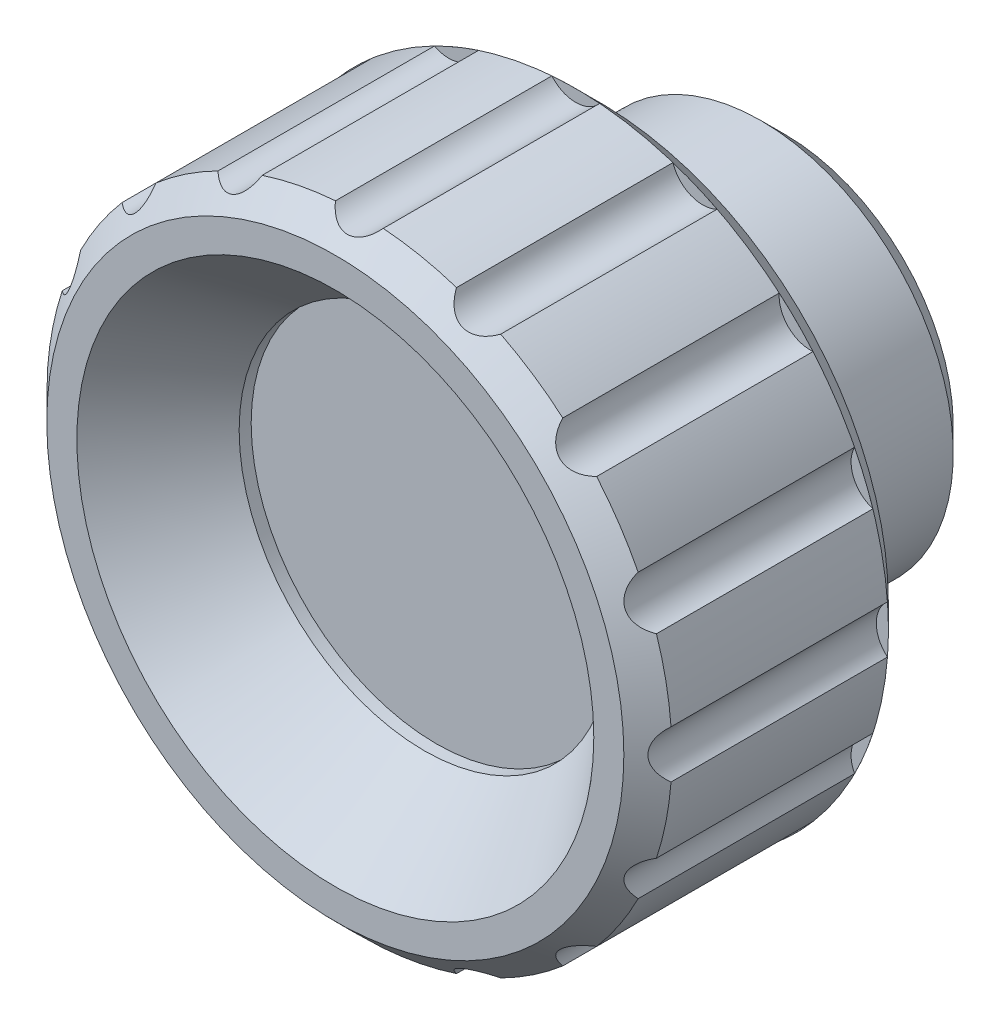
ISO-10303-21;
HEADER;
FILE_DESCRIPTION(('STEP AP214'),'2;1');
FILE_NAME('part.step','',(''),(''),'','','');
FILE_SCHEMA(('AUTOMOTIVE_DESIGN { 1 0 10303 214 1 1 1 1 }'));
ENDSEC;
DATA;
#1=APPLICATION_CONTEXT('core data for automotive mechanical design processes');
#2=APPLICATION_PROTOCOL_DEFINITION('international standard','automotive_design',2000,#1);
#3=PRODUCT_CONTEXT('',#1,'mechanical');
#4=PRODUCT('Part','Part','',(#3));
#5=PRODUCT_RELATED_PRODUCT_CATEGORY('part','',(#4));
#6=PRODUCT_DEFINITION_FORMATION('','',#4);
#7=PRODUCT_DEFINITION_CONTEXT('part definition',#1,'design');
#8=PRODUCT_DEFINITION('design','',#6,#7);
#9=PRODUCT_DEFINITION_SHAPE('','',#8);
#10=(LENGTH_UNIT() NAMED_UNIT(*) SI_UNIT(.MILLI.,.METRE.));
#11=(NAMED_UNIT(*) PLANE_ANGLE_UNIT() SI_UNIT($,.RADIAN.));
#12=(NAMED_UNIT(*) SI_UNIT($,.STERADIAN.) SOLID_ANGLE_UNIT());
#13=UNCERTAINTY_MEASURE_WITH_UNIT(LENGTH_MEASURE(1.E-05),#10,'distance_accuracy_value','');
#14=(GEOMETRIC_REPRESENTATION_CONTEXT(3) GLOBAL_UNCERTAINTY_ASSIGNED_CONTEXT((#13)) GLOBAL_UNIT_ASSIGNED_CONTEXT((#10,
#11,#12)) REPRESENTATION_CONTEXT('',''));
#15=CARTESIAN_POINT('',(0.,0.,0.));
#16=DIRECTION('',(0.,0.,1.));
#17=DIRECTION('',(1.,0.,0.));
#18=AXIS2_PLACEMENT_3D('',#15,#16,#17);
#19=CARTESIAN_POINT('',(10.2499999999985,-1.30740325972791E-12,19.0000000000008));
#20=DIRECTION('',(0.,0.,1.));
#21=DIRECTION('',(0.,-1.,0.));
#22=AXIS2_PLACEMENT_3D('',#19,#20,#21);
#23=PLANE('',#22);
#24=CARTESIAN_POINT('',(-1.51981051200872E-12,-1.30740325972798E-12,19.0000000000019));
#25=DIRECTION('',(0.,0.,1.));
#26=DIRECTION('',(1.,0.,0.));
#27=AXIS2_PLACEMENT_3D('',#24,#25,#26);
#28=CIRCLE('',#27,11.9999999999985);
#29=CARTESIAN_POINT('',(11.999999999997,-1.30740325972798E-12,19.0000000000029));
#30=VERTEX_POINT('',#29);
#31=EDGE_CURVE('E342',#30,#30,#28,.T.);
#32=ORIENTED_EDGE('',*,*,#31,.T.);
#33=EDGE_LOOP('',(#32));
#34=FACE_BOUND('',#33,.T.);
#35=CARTESIAN_POINT('',(-1.51981051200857E-12,-1.30740325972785E-12,19.));
#36=DIRECTION('',(0.,0.,1.));
#37=DIRECTION('',(1.,0.,0.));
#38=AXIS2_PLACEMENT_3D('',#35,#36,#37);
#39=CIRCLE('',#38,10.75);
#40=CARTESIAN_POINT('',(10.7499999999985,-1.30740325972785E-12,19.0000000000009));
#41=VERTEX_POINT('',#40);
#42=EDGE_CURVE('E456',#41,#41,#39,.T.);
#43=ORIENTED_EDGE('',*,*,#42,.F.);
#44=EDGE_LOOP('',(#43));
#45=FACE_BOUND('',#44,.T.);
#46=ADVANCED_FACE('F14',(#34,#45),#23,.T.);
#47=CARTESIAN_POINT('',(11.4999999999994,-5.50485583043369E-13,8.00000000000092));
#48=DIRECTION('',(0.,0.,-1.));
#49=DIRECTION('',(0.,1.,0.));
#50=AXIS2_PLACEMENT_3D('',#47,#48,#49);
#51=PLANE('',#50);
#52=CARTESIAN_POINT('',(-6.39920215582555E-13,-5.50485583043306E-13,8.));
#53=DIRECTION('',(0.,0.,-1.));
#54=DIRECTION('',(0.,1.,0.));
#55=AXIS2_PLACEMENT_3D('',#52,#53,#54);
#56=CIRCLE('',#55,8.);
#57=CARTESIAN_POINT('',(-6.39920215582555E-13,7.99999999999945,8.00000000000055));
#58=VERTEX_POINT('',#57);
#59=EDGE_CURVE('E369',#58,#58,#56,.T.);
#60=ORIENTED_EDGE('',*,*,#59,.F.);
#61=EDGE_LOOP('',(#60));
#62=FACE_BOUND('',#61,.T.);
#63=CARTESIAN_POINT('',(-6.39920215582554E-13,-5.50485583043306E-13,8.));
#64=DIRECTION('',(0.,0.,-1.));
#65=DIRECTION('',(-1.,0.,0.));
#66=AXIS2_PLACEMENT_3D('',#63,#64,#65);
#67=CIRCLE('',#66,10.7777800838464);
#68=CARTESIAN_POINT('',(-10.7777800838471,-5.50485583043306E-13,7.99999999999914));
#69=VERTEX_POINT('',#68);
#70=EDGE_CURVE('E353',#69,#69,#67,.T.);
#71=ORIENTED_EDGE('',*,*,#70,.T.);
#72=EDGE_LOOP('',(#71));
#73=FACE_BOUND('',#72,.T.);
#74=ADVANCED_FACE('F423',(#62,#73),#51,.T.);
#75=CARTESIAN_POINT('',(7.,0.,0.30000000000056));
#76=DIRECTION('',(0.,0.,-1.));
#77=DIRECTION('',(0.,1.,0.));
#78=AXIS2_PLACEMENT_3D('',#75,#76,#77);
#79=PLANE('',#78);
#80=CARTESIAN_POINT('',(0.,0.,0.3));
#81=DIRECTION('',(0.,0.,-1.));
#82=DIRECTION('',(0.,1.,0.));
#83=AXIS2_PLACEMENT_3D('',#80,#81,#82);
#84=CIRCLE('',#83,7.);
#85=CARTESIAN_POINT('',(0.,6.99999999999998,0.300000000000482));
#86=VERTEX_POINT('',#85);
#87=EDGE_CURVE('E361',#86,#86,#84,.T.);
#88=ORIENTED_EDGE('',*,*,#87,.T.);
#89=EDGE_LOOP('',(#88));
#90=FACE_BOUND('',#89,.T.);
#91=CARTESIAN_POINT('',(0.,0.,0.3));
#92=DIRECTION('',(0.,0.,-1.));
#93=DIRECTION('',(-1.,0.,0.));
#94=AXIS2_PLACEMENT_3D('',#91,#92,#93);
#95=CIRCLE('',#94,4.);
#96=CARTESIAN_POINT('',(-4.00000000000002,0.,0.29999999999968));
#97=VERTEX_POINT('',#96);
#98=EDGE_CURVE('E357',#97,#97,#95,.T.);
#99=ORIENTED_EDGE('',*,*,#98,.F.);
#100=EDGE_LOOP('',(#99));
#101=FACE_BOUND('',#100,.T.);
#102=ADVANCED_FACE('F430',(#90,#101),#79,.T.);
#103=CARTESIAN_POINT('',(0.,0.,0.3));
#104=DIRECTION('',(0.,0.,-1.));
#105=DIRECTION('',(0.,1.,0.));
#106=AXIS2_PLACEMENT_3D('',#103,#104,#105);
#107=CYLINDRICAL_SURFACE('',#106,8.);
#108=ORIENTED_EDGE('',*,*,#59,.T.);
#109=EDGE_LOOP('',(#108));
#110=FACE_BOUND('',#109,.T.);
#111=CARTESIAN_POINT('',(-1.03987035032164E-13,0.,1.3));
#112=DIRECTION('',(0.,0.,-1.));
#113=DIRECTION('',(0.,1.,0.));
#114=AXIS2_PLACEMENT_3D('',#111,#112,#113);
#115=CIRCLE('',#114,8.);
#116=CARTESIAN_POINT('',(-1.03987035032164E-13,7.99999999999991,1.30000000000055));
#117=VERTEX_POINT('',#116);
#118=EDGE_CURVE('E366',#117,#117,#115,.T.);
#119=ORIENTED_EDGE('',*,*,#118,.F.);
#120=EDGE_LOOP('',(#119));
#121=FACE_BOUND('',#120,.T.);
#122=ADVANCED_FACE('F1116',(#110,#121),#107,.T.);
#123=CARTESIAN_POINT('',(0.,0.,0.3));
#124=DIRECTION('',(0.,0.,1.));
#125=DIRECTION('',(0.,-1.,0.));
#126=AXIS2_PLACEMENT_3D('',#123,#124,#125);
#127=CONICAL_SURFACE('',#126,7.,0.785398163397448);
#128=ORIENTED_EDGE('',*,*,#118,.T.);
#129=EDGE_LOOP('',(#128));
#130=FACE_BOUND('',#129,.T.);
#131=ORIENTED_EDGE('',*,*,#87,.F.);
#132=EDGE_LOOP('',(#131));
#133=FACE_BOUND('',#132,.T.);
#134=ADVANCED_FACE('F1086',(#130,#133),#127,.T.);
#135=CARTESIAN_POINT('',(0.,0.,0.));
#136=DIRECTION('',(0.,0.,-1.));
#137=DIRECTION('',(-1.,0.,0.));
#138=AXIS2_PLACEMENT_3D('',#135,#136,#137);
#139=PLANE('',#138);
#140=CARTESIAN_POINT('',(0.,0.,0.));
#141=DIRECTION('',(0.,0.,-1.));
#142=DIRECTION('',(-1.,0.,0.));
#143=AXIS2_PLACEMENT_3D('',#140,#141,#142);
#144=CIRCLE('',#143,3.45);
#145=CARTESIAN_POINT('',(-3.45,0.,-2.75965592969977E-13));
#146=VERTEX_POINT('',#145);
#147=EDGE_CURVE('E378',#146,#146,#144,.F.);
#148=ORIENTED_EDGE('',*,*,#147,.T.);
#149=EDGE_LOOP('',(#148));
#150=FACE_BOUND('',#149,.T.);
#151=CARTESIAN_POINT('',(0.,0.,0.));
#152=DIRECTION('',(0.,0.,-1.));
#153=DIRECTION('',(-1.,0.,0.));
#154=AXIS2_PLACEMENT_3D('',#151,#152,#153);
#155=CIRCLE('',#154,4.);
#156=CARTESIAN_POINT('',(-4.,0.,-3.19960107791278E-13));
#157=VERTEX_POINT('',#156);
#158=EDGE_CURVE('E358',#157,#157,#155,.T.);
#159=ORIENTED_EDGE('',*,*,#158,.T.);
#160=EDGE_LOOP('',(#159));
#161=FACE_BOUND('',#160,.T.);
#162=ADVANCED_FACE('F1080',(#150,#161),#139,.T.);
#163=CARTESIAN_POINT('',(0.,0.,0.));
#164=DIRECTION('',(0.,0.,1.));
#165=DIRECTION('',(1.,0.,0.));
#166=AXIS2_PLACEMENT_3D('',#163,#164,#165);
#167=CYLINDRICAL_SURFACE('',#166,4.);
#168=ORIENTED_EDGE('',*,*,#158,.F.);
#169=EDGE_LOOP('',(#168));
#170=FACE_BOUND('',#169,.T.);
#171=ORIENTED_EDGE('',*,*,#98,.T.);
#172=EDGE_LOOP('',(#171));
#173=FACE_BOUND('',#172,.T.);
#174=ADVANCED_FACE('F1085',(#170,#173),#167,.T.);
#175=CARTESIAN_POINT('',(-6.39920215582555E-13,-5.50485583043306E-13,8.));
#176=DIRECTION('',(0.,0.,-1.));
#177=DIRECTION('',(-1.,0.,0.));
#178=AXIS2_PLACEMENT_3D('',#175,#176,#177);
#179=CYLINDRICAL_SURFACE('',#178,3.);
#180=CARTESIAN_POINT('',(0.,0.,0.45));
#181=DIRECTION('',(0.,0.,-1.));
#182=DIRECTION('',(-1.,0.,0.));
#183=AXIS2_PLACEMENT_3D('',#180,#181,#182);
#184=CIRCLE('',#183,3.);
#185=CARTESIAN_POINT('',(-3.00000000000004,0.,0.44999999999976));
#186=VERTEX_POINT('',#185);
#187=EDGE_CURVE('E375',#186,#186,#184,.T.);
#188=ORIENTED_EDGE('',*,*,#187,.T.);
#189=EDGE_LOOP('',(#188));
#190=FACE_BOUND('',#189,.T.);
#191=CARTESIAN_POINT('',(-6.39920215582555E-13,-5.50485583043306E-13,8.));
#192=DIRECTION('',(0.,0.,-1.));
#193=DIRECTION('',(-1.,0.,0.));
#194=AXIS2_PLACEMENT_3D('',#191,#192,#193);
#195=CIRCLE('',#194,3.);
#196=CARTESIAN_POINT('',(-3.00000000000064,-5.50485583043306E-13,7.99999999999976));
#197=VERTEX_POINT('',#196);
#198=EDGE_CURVE('E354',#197,#197,#195,.T.);
#199=ORIENTED_EDGE('',*,*,#198,.F.);
#200=EDGE_LOOP('',(#199));
#201=FACE_BOUND('',#200,.T.);
#202=ADVANCED_FACE('F1098',(#190,#201),#179,.F.);
#203=CARTESIAN_POINT('',(-6.39920215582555E-13,-5.50485583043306E-13,8.));
#204=DIRECTION('',(0.,0.,-1.));
#205=DIRECTION('',(-1.,0.,0.));
#206=AXIS2_PLACEMENT_3D('',#203,#204,#205);
#207=PLANE('',#206);
#208=ORIENTED_EDGE('',*,*,#198,.T.);
#209=EDGE_LOOP('',(#208));
#210=FACE_BOUND('',#209,.T.);
#211=ADVANCED_FACE('F1108',(#210),#207,.T.);
#212=CARTESIAN_POINT('',(0.,0.,0.45));
#213=DIRECTION('',(0.,0.,-1.));
#214=DIRECTION('',(-1.,0.,0.));
#215=AXIS2_PLACEMENT_3D('',#212,#213,#214);
#216=CONICAL_SURFACE('',#215,3.,0.785398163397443);
#217=ORIENTED_EDGE('',*,*,#147,.F.);
#218=EDGE_LOOP('',(#217));
#219=FACE_BOUND('',#218,.T.);
#220=ORIENTED_EDGE('',*,*,#187,.F.);
#221=EDGE_LOOP('',(#220));
#222=FACE_BOUND('',#221,.T.);
#223=ADVANCED_FACE('F16',(#219,#222),#216,.F.);
#224=CARTESIAN_POINT('',(-6.39917129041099E-13,-5.50482927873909E-13,7.99996141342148));
#225=DIRECTION('',(0.,0.,1.));
#226=DIRECTION('',(1.,0.,0.));
#227=AXIS2_PLACEMENT_3D('',#224,#225,#226);
#228=CONICAL_SURFACE('',#227,11.9999999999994,0.785398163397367);
#229=CARTESIAN_POINT('',(-7.19907155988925E-13,-6.19293625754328E-13,8.99996141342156));
#230=DIRECTION('',(0.,0.,1.));
#231=DIRECTION('',(1.,0.,0.));
#232=AXIS2_PLACEMENT_3D('',#229,#230,#231);
#233=CIRCLE('',#232,12.9999999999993);
#234=CARTESIAN_POINT('',(12.9999999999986,-6.19293625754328E-13,8.9999614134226));
#235=VERTEX_POINT('',#234);
#236=EDGE_CURVE('E349',#235,#235,#233,.T.);
#237=ORIENTED_EDGE('',*,*,#236,.F.);
#238=EDGE_LOOP('',(#237));
#239=FACE_BOUND('',#238,.T.);
#240=CARTESIAN_POINT('',(-6.39917129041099E-13,-5.50482927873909E-13,7.99996141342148));
#241=DIRECTION('',(0.,0.,1.));
#242=DIRECTION('',(1.,0.,0.));
#243=AXIS2_PLACEMENT_3D('',#240,#241,#242);
#244=CIRCLE('',#243,11.9999999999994);
#245=CARTESIAN_POINT('',(11.9999999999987,-5.50482927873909E-13,7.99996141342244));
#246=VERTEX_POINT('',#245);
#247=EDGE_CURVE('E336',#246,#246,#244,.T.);
#248=ORIENTED_EDGE('',*,*,#247,.T.);
#249=EDGE_LOOP('',(#248));
#250=FACE_BOUND('',#249,.T.);
#251=ADVANCED_FACE('F1065',(#239,#250),#228,.T.);
#252=CARTESIAN_POINT('',(-6.39920215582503E-13,-5.50485583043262E-13,7.99999999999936));
#253=DIRECTION('',(0.,0.,1.));
#254=DIRECTION('',(1.,0.,0.));
#255=AXIS2_PLACEMENT_3D('',#252,#253,#254);
#256=CYLINDRICAL_SURFACE('',#255,12.9999999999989);
#257=CARTESIAN_POINT('',(-1.4398204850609E-12,-1.23859256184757E-12,18.0000000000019));
#258=DIRECTION('',(0.,0.,1.));
#259=DIRECTION('',(1.,0.,0.));
#260=AXIS2_PLACEMENT_3D('',#257,#258,#259);
#261=CIRCLE('',#260,12.9999999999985);
#262=CARTESIAN_POINT('',(-4.04215376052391,-12.355605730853,18.0000000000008));
#263=VERTEX_POINT('',#262);
#264=CARTESIAN_POINT('',(-0.993822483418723,-12.9619565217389,18.000000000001));
#265=VERTEX_POINT('',#264);
#266=EDGE_CURVE('E512',#263,#265,#261,.T.);
#267=ORIENTED_EDGE('',*,*,#266,.F.);
#268=DIRECTION('',(0.,0.,1.));
#269=VECTOR('',#268,1.);
#270=CARTESIAN_POINT('',(-4.04215376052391,-12.355605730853,14.));
#271=LINE('',#270,#269);
#272=CARTESIAN_POINT('',(-4.04215376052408,-12.3556057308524,9.));
#273=VERTEX_POINT('',#272);
#274=EDGE_CURVE('E333',#263,#273,#271,.F.);
#275=ORIENTED_EDGE('',*,*,#274,.T.);
#276=CARTESIAN_POINT('',(-7.19910242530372E-13,-6.19296280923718E-13,9.));
#277=DIRECTION('',(0.,0.,1.));
#278=DIRECTION('',(1.,0.,0.));
#279=AXIS2_PLACEMENT_3D('',#276,#277,#278);
#280=CIRCLE('',#279,12.9999999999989);
#281=CARTESIAN_POINT('',(-5.87849826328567,-11.5949669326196,9.));
#282=VERTEX_POINT('',#281);
#283=EDGE_CURVE('E9',#282,#273,#280,.T.);
#284=ORIENTED_EDGE('',*,*,#283,.F.);
#285=DIRECTION('',(0.,0.,1.));
#286=VECTOR('',#285,1.);
#287=CARTESIAN_POINT('',(-5.8784982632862,-11.5949669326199,14.));
#288=LINE('',#287,#286);
#289=CARTESIAN_POINT('',(-5.87849826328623,-11.5949669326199,18.0000000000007));
#290=VERTEX_POINT('',#289);
#291=EDGE_CURVE('E330',#282,#290,#288,.T.);
#292=ORIENTED_EDGE('',*,*,#291,.T.);
#293=CARTESIAN_POINT('',(-8.46274873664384,-9.86822597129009,18.0000000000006));
#294=VERTEX_POINT('',#293);
#295=EDGE_CURVE('E517',#294,#290,#261,.T.);
#296=ORIENTED_EDGE('',*,*,#295,.F.);
#297=DIRECTION('',(0.,0.,1.));
#298=VECTOR('',#297,1.);
#299=CARTESIAN_POINT('',(-8.46274873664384,-9.86822597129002,14.));
#300=LINE('',#299,#298);
#301=CARTESIAN_POINT('',(-8.46274873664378,-9.86822597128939,9.));
#302=VERTEX_POINT('',#301);
#303=EDGE_CURVE('E327',#294,#302,#300,.F.);
#304=ORIENTED_EDGE('',*,*,#303,.T.);
#305=CARTESIAN_POINT('',(-7.19910242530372E-13,-6.19296280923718E-13,9.));
#306=DIRECTION('',(0.,0.,1.));
#307=DIRECTION('',(1.,0.,0.));
#308=AXIS2_PLACEMENT_3D('',#305,#306,#307);
#309=CIRCLE('',#308,12.9999999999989);
#310=CARTESIAN_POINT('',(-9.86822597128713,-8.46274873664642,9.));
#311=VERTEX_POINT('',#310);
#312=EDGE_CURVE('E22',#311,#302,#309,.T.);
#313=ORIENTED_EDGE('',*,*,#312,.F.);
#314=DIRECTION('',(0.,0.,1.));
#315=VECTOR('',#314,1.);
#316=CARTESIAN_POINT('',(-9.86822597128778,-8.46274873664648,14.));
#317=LINE('',#316,#315);
#318=CARTESIAN_POINT('',(-9.86822597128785,-8.46274873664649,18.0000000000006));
#319=VERTEX_POINT('',#318);
#320=EDGE_CURVE('E324',#311,#319,#317,.T.);
#321=ORIENTED_EDGE('',*,*,#320,.T.);
#322=CARTESIAN_POINT('',(-11.5949669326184,-5.87849826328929,18.0000000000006));
#323=VERTEX_POINT('',#322);
#324=EDGE_CURVE('E746',#323,#319,#261,.T.);
#325=ORIENTED_EDGE('',*,*,#324,.F.);
#326=DIRECTION('',(0.,0.,1.));
#327=VECTOR('',#326,1.);
#328=CARTESIAN_POINT('',(-11.5949669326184,-5.87849826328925,14.));
#329=LINE('',#328,#327);
#330=CARTESIAN_POINT('',(-11.5949669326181,-5.87849826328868,9.));
#331=VERTEX_POINT('',#330);
#332=EDGE_CURVE('E321',#323,#331,#329,.F.);
#333=ORIENTED_EDGE('',*,*,#332,.T.);
#334=CARTESIAN_POINT('',(-7.19910242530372E-13,-6.19296280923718E-13,9.));
#335=DIRECTION('',(0.,0.,1.));
#336=DIRECTION('',(1.,0.,0.));
#337=AXIS2_PLACEMENT_3D('',#334,#335,#336);
#338=CIRCLE('',#337,12.9999999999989);
#339=CARTESIAN_POINT('',(-12.3556057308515,-4.04215376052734,9.));
#340=VERTEX_POINT('',#339);
#341=EDGE_CURVE('E794',#340,#331,#338,.T.);
#342=ORIENTED_EDGE('',*,*,#341,.F.);
#343=DIRECTION('',(0.,0.,1.));
#344=VECTOR('',#343,1.);
#345=CARTESIAN_POINT('',(-12.355605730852,-4.04215376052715,14.));
#346=LINE('',#345,#344);
#347=CARTESIAN_POINT('',(-12.3556057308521,-4.04215376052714,18.0000000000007));
#348=VERTEX_POINT('',#347);
#349=EDGE_CURVE('E318',#340,#348,#346,.T.);
#350=ORIENTED_EDGE('',*,*,#349,.T.);
#351=CARTESIAN_POINT('',(-12.9619565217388,-0.99382248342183,18.0000000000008));
#352=VERTEX_POINT('',#351);
#353=EDGE_CURVE('E748',#352,#348,#261,.T.);
#354=ORIENTED_EDGE('',*,*,#353,.F.);
#355=DIRECTION('',(0.,0.,1.));
#356=VECTOR('',#355,1.);
#357=CARTESIAN_POINT('',(-12.9619565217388,-0.993822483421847,14.));
#358=LINE('',#357,#356);
#359=CARTESIAN_POINT('',(-12.9619565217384,-0.99382248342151,9.));
#360=VERTEX_POINT('',#359);
#361=EDGE_CURVE('E315',#352,#360,#358,.F.);
#362=ORIENTED_EDGE('',*,*,#361,.T.);
#363=CARTESIAN_POINT('',(-7.19910242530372E-13,-6.19296280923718E-13,9.));
#364=DIRECTION('',(0.,0.,1.));
#365=DIRECTION('',(1.,0.,0.));
#366=AXIS2_PLACEMENT_3D('',#363,#364,#365);
#367=CIRCLE('',#366,12.9999999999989);
#368=CARTESIAN_POINT('',(-12.9619565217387,0.993822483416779,9.));
#369=VERTEX_POINT('',#368);
#370=EDGE_CURVE('E792',#369,#360,#367,.T.);
#371=ORIENTED_EDGE('',*,*,#370,.F.);
#372=DIRECTION('',(0.,0.,1.));
#373=VECTOR('',#372,1.);
#374=CARTESIAN_POINT('',(-12.961956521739,0.993822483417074,14.));
#375=LINE('',#374,#373);
#376=CARTESIAN_POINT('',(-12.961956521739,0.993822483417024,18.000000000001));
#377=VERTEX_POINT('',#376);
#378=EDGE_CURVE('E312',#369,#377,#375,.T.);
#379=ORIENTED_EDGE('',*,*,#378,.T.);
#380=CARTESIAN_POINT('',(-12.3556057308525,4.04215376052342,18.0000000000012));
#381=VERTEX_POINT('',#380);
#382=EDGE_CURVE('E751',#381,#377,#261,.T.);
#383=ORIENTED_EDGE('',*,*,#382,.F.);
#384=DIRECTION('',(0.,0.,1.));
#385=VECTOR('',#384,1.);
#386=CARTESIAN_POINT('',(-12.3556057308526,4.04215376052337,14.));
#387=LINE('',#386,#385);
#388=CARTESIAN_POINT('',(-12.3556057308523,4.04215376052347,9.));
#389=VERTEX_POINT('',#388);
#390=EDGE_CURVE('E309',#381,#389,#387,.F.);
#391=ORIENTED_EDGE('',*,*,#390,.T.);
#392=CARTESIAN_POINT('',(-7.19910242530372E-13,-6.19296280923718E-13,9.));
#393=DIRECTION('',(0.,0.,1.));
#394=DIRECTION('',(1.,0.,0.));
#395=AXIS2_PLACEMENT_3D('',#392,#393,#394);
#396=CIRCLE('',#395,12.9999999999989);
#397=CARTESIAN_POINT('',(-11.5949669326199,5.87849826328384,9.));
#398=VERTEX_POINT('',#397);
#399=EDGE_CURVE('E790',#398,#389,#396,.T.);
#400=ORIENTED_EDGE('',*,*,#399,.F.);
#401=DIRECTION('',(0.,0.,1.));
#402=VECTOR('',#401,1.);
#403=CARTESIAN_POINT('',(-11.5949669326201,5.87849826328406,14.));
#404=LINE('',#403,#402);
#405=CARTESIAN_POINT('',(-11.5949669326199,5.87849826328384,18.0000000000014));
#406=VERTEX_POINT('',#405);
#407=EDGE_CURVE('E306',#398,#406,#404,.T.);
#408=ORIENTED_EDGE('',*,*,#407,.T.);
#409=CARTESIAN_POINT('',(-9.86822597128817,8.46274873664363,18.0000000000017));
#410=VERTEX_POINT('',#409);
#411=EDGE_CURVE('E754',#410,#406,#261,.T.);
#412=ORIENTED_EDGE('',*,*,#411,.F.);
#413=DIRECTION('',(0.,0.,1.));
#414=VECTOR('',#413,1.);
#415=CARTESIAN_POINT('',(-9.86822597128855,8.46274873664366,14.));
#416=LINE('',#415,#414);
#417=CARTESIAN_POINT('',(-9.86822597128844,8.46274873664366,9.));
#418=VERTEX_POINT('',#417);
#419=EDGE_CURVE('E303',#410,#418,#416,.F.);
#420=ORIENTED_EDGE('',*,*,#419,.T.);
#421=CARTESIAN_POINT('',(-7.19910242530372E-13,-6.19296280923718E-13,9.));
#422=DIRECTION('',(0.,0.,1.));
#423=DIRECTION('',(1.,0.,0.));
#424=AXIS2_PLACEMENT_3D('',#421,#422,#423);
#425=CIRCLE('',#424,12.9999999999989);
#426=CARTESIAN_POINT('',(-8.462748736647,9.86822597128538,9.));
#427=VERTEX_POINT('',#426);
#428=EDGE_CURVE('E788',#427,#418,#425,.T.);
#429=ORIENTED_EDGE('',*,*,#428,.F.);
#430=DIRECTION('',(0.,0.,1.));
#431=VECTOR('',#430,1.);
#432=CARTESIAN_POINT('',(-8.462748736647,9.86822597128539,14.));
#433=LINE('',#432,#431);
#434=CARTESIAN_POINT('',(-8.46274873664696,9.86822597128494,18.0000000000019));
#435=VERTEX_POINT('',#434);
#436=EDGE_CURVE('E300',#427,#435,#433,.T.);
#437=ORIENTED_EDGE('',*,*,#436,.T.);
#438=CARTESIAN_POINT('',(-5.87849826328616,11.5949669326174,18.0000000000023));
#439=VERTEX_POINT('',#438);
#440=EDGE_CURVE('E758',#439,#435,#261,.T.);
#441=ORIENTED_EDGE('',*,*,#440,.F.);
#442=DIRECTION('',(0.,0.,1.));
#443=VECTOR('',#442,1.);
#444=CARTESIAN_POINT('',(-5.87849826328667,11.5949669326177,14.));
#445=LINE('',#444,#443);
#446=CARTESIAN_POINT('',(-5.87849826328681,11.5949669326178,9.));
#447=VERTEX_POINT('',#446);
#448=EDGE_CURVE('E297',#439,#447,#445,.F.);
#449=ORIENTED_EDGE('',*,*,#448,.T.);
#450=CARTESIAN_POINT('',(-7.19910242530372E-13,-6.19296280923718E-13,9.));
#451=DIRECTION('',(0.,0.,1.));
#452=DIRECTION('',(1.,0.,0.));
#453=AXIS2_PLACEMENT_3D('',#450,#451,#452);
#454=CIRCLE('',#453,12.9999999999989);
#455=CARTESIAN_POINT('',(-4.04215376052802,12.3556057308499,9.));
#456=VERTEX_POINT('',#455);
#457=EDGE_CURVE('E786',#456,#447,#454,.T.);
#458=ORIENTED_EDGE('',*,*,#457,.F.);
#459=DIRECTION('',(0.,0.,1.));
#460=VECTOR('',#459,1.);
#461=CARTESIAN_POINT('',(-4.04215376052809,12.3556057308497,14.));
#462=LINE('',#461,#460);
#463=CARTESIAN_POINT('',(-4.04215376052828,12.3556057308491,18.0000000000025));
#464=VERTEX_POINT('',#463);
#465=EDGE_CURVE('E294',#456,#464,#462,.T.);
#466=ORIENTED_EDGE('',*,*,#465,.T.);
#467=CARTESIAN_POINT('',(-0.993822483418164,12.9619565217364,18.0000000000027));
#468=VERTEX_POINT('',#467);
#469=EDGE_CURVE('E761',#468,#464,#261,.T.);
#470=ORIENTED_EDGE('',*,*,#469,.F.);
#471=DIRECTION('',(0.,0.,1.));
#472=VECTOR('',#471,1.);
#473=CARTESIAN_POINT('',(-0.993822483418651,12.961956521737,14.));
#474=LINE('',#473,#472);
#475=CARTESIAN_POINT('',(-0.993822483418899,12.9619565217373,9.));
#476=VERTEX_POINT('',#475);
#477=EDGE_CURVE('E291',#468,#476,#474,.F.);
#478=ORIENTED_EDGE('',*,*,#477,.T.);
#479=CARTESIAN_POINT('',(-7.19910242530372E-13,-6.19296280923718E-13,9.));
#480=DIRECTION('',(0.,0.,1.));
#481=DIRECTION('',(1.,0.,0.));
#482=AXIS2_PLACEMENT_3D('',#479,#480,#481);
#483=CIRCLE('',#482,12.9999999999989);
#484=CARTESIAN_POINT('',(0.993822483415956,12.9619565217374,9.));
#485=VERTEX_POINT('',#484);
#486=EDGE_CURVE('E784',#485,#476,#483,.T.);
#487=ORIENTED_EDGE('',*,*,#486,.F.);
#488=DIRECTION('',(0.,0.,1.));
#489=VECTOR('',#488,1.);
#490=CARTESIAN_POINT('',(0.99382248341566,12.9619565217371,14.));
#491=LINE('',#490,#489);
#492=CARTESIAN_POINT('',(0.993822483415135,12.9619565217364,18.0000000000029));
#493=VERTEX_POINT('',#492);
#494=EDGE_CURVE('E289',#485,#493,#491,.T.);
#495=ORIENTED_EDGE('',*,*,#494,.T.);
#496=CARTESIAN_POINT('',(4.04215376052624,12.3556057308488,18.0000000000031));
#497=VERTEX_POINT('',#496);
#498=EDGE_CURVE('E247',#497,#493,#261,.T.);
#499=ORIENTED_EDGE('',*,*,#498,.F.);
#500=DIRECTION('',(0.,0.,1.));
#501=VECTOR('',#500,1.);
#502=CARTESIAN_POINT('',(4.04215376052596,12.3556057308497,14.));
#503=LINE('',#502,#501);
#504=CARTESIAN_POINT('',(4.0421537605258,12.3556057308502,9.));
#505=VERTEX_POINT('',#504);
#506=EDGE_CURVE('E236',#497,#505,#503,.F.);
#507=ORIENTED_EDGE('',*,*,#506,.T.);
#508=CARTESIAN_POINT('',(-7.19910242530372E-13,-6.19296280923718E-13,9.));
#509=DIRECTION('',(0.,0.,1.));
#510=DIRECTION('',(1.,0.,0.));
#511=AXIS2_PLACEMENT_3D('',#508,#509,#510);
#512=CIRCLE('',#511,12.9999999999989);
#513=CARTESIAN_POINT('',(5.87849826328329,11.5949669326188,9.));
#514=VERTEX_POINT('',#513);
#515=EDGE_CURVE('E224',#514,#505,#512,.T.);
#516=ORIENTED_EDGE('',*,*,#515,.F.);
#517=DIRECTION('',(0.,0.,1.));
#518=VECTOR('',#517,1.);
#519=CARTESIAN_POINT('',(5.87849826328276,11.5949669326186,14.));
#520=LINE('',#519,#518);
#521=CARTESIAN_POINT('',(5.87849826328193,11.5949669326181,18.0000000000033));
#522=VERTEX_POINT('',#521);
#523=EDGE_CURVE('E238',#514,#522,#520,.T.);
#524=ORIENTED_EDGE('',*,*,#523,.T.);
#525=CARTESIAN_POINT('',(8.46274873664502,9.86822597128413,18.0000000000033));
#526=VERTEX_POINT('',#525);
#527=EDGE_CURVE('E766',#526,#522,#261,.T.);
#528=ORIENTED_EDGE('',*,*,#527,.F.);
#529=DIRECTION('',(0.,0.,1.));
#530=VECTOR('',#529,1.);
#531=CARTESIAN_POINT('',(8.4627487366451,9.86822597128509,14.));
#532=LINE('',#531,#530);
#533=CARTESIAN_POINT('',(8.46274873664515,9.86822597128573,9.));
#534=VERTEX_POINT('',#533);
#535=EDGE_CURVE('E251',#526,#534,#532,.F.);
#536=ORIENTED_EDGE('',*,*,#535,.T.);
#537=CARTESIAN_POINT('',(-7.19910242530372E-13,-6.19296280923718E-13,9.));
#538=DIRECTION('',(0.,0.,1.));
#539=DIRECTION('',(1.,0.,0.));
#540=AXIS2_PLACEMENT_3D('',#537,#538,#539);
#541=CIRCLE('',#540,12.9999999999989);
#542=CARTESIAN_POINT('',(9.86822597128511,8.46274873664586,9.));
#543=VERTEX_POINT('',#542);
#544=EDGE_CURVE('E231',#543,#534,#541,.T.);
#545=ORIENTED_EDGE('',*,*,#544,.F.);
#546=DIRECTION('',(0.,0.,1.));
#547=VECTOR('',#546,1.);
#548=CARTESIAN_POINT('',(9.86822597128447,8.4627487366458,14.));
#549=LINE('',#548,#547);
#550=CARTESIAN_POINT('',(9.8682259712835,8.46274873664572,18.0000000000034));
#551=VERTEX_POINT('',#550);
#552=EDGE_CURVE('E248',#543,#551,#549,.T.);
#553=ORIENTED_EDGE('',*,*,#552,.T.);
#554=CARTESIAN_POINT('',(11.5949669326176,5.87849826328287,18.0000000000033));
#555=VERTEX_POINT('',#554);
#556=EDGE_CURVE('E350',#555,#551,#261,.T.);
#557=ORIENTED_EDGE('',*,*,#556,.F.);
#558=DIRECTION('',(0.,0.,1.));
#559=VECTOR('',#558,1.);
#560=CARTESIAN_POINT('',(11.594966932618,5.87849826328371,14.));
#561=LINE('',#560,#559);
#562=CARTESIAN_POINT('',(11.5949669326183,5.87849826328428,9.));
#563=VERTEX_POINT('',#562);
#564=EDGE_CURVE('E260',#555,#563,#561,.F.);
#565=ORIENTED_EDGE('',*,*,#564,.T.);
#566=CARTESIAN_POINT('',(-7.19910242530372E-13,-6.19296280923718E-13,9.));
#567=DIRECTION('',(0.,0.,1.));
#568=DIRECTION('',(1.,0.,0.));
#569=AXIS2_PLACEMENT_3D('',#566,#567,#568);
#570=CIRCLE('',#569,12.9999999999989);
#571=CARTESIAN_POINT('',(12.3556057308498,4.04215376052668,9.));
#572=VERTEX_POINT('',#571);
#573=EDGE_CURVE('E775',#572,#563,#570,.T.);
#574=ORIENTED_EDGE('',*,*,#573,.F.);
#575=DIRECTION('',(0.,0.,1.));
#576=VECTOR('',#575,1.);
#577=CARTESIAN_POINT('',(12.3556057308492,4.04215376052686,14.));
#578=LINE('',#577,#576);
#579=CARTESIAN_POINT('',(12.3556057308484,4.04215376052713,18.0000000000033));
#580=VERTEX_POINT('',#579);
#581=EDGE_CURVE('E257',#572,#580,#578,.T.);
#582=ORIENTED_EDGE('',*,*,#581,.T.);
#583=CARTESIAN_POINT('',(12.9619565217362,0.993822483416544,18.000000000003));
#584=VERTEX_POINT('',#583);
#585=EDGE_CURVE('E346',#584,#580,#261,.T.);
#586=ORIENTED_EDGE('',*,*,#585,.F.);
#587=DIRECTION('',(0.,0.,1.));
#588=VECTOR('',#587,1.);
#589=CARTESIAN_POINT('',(12.9619565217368,0.993822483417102,14.));
#590=LINE('',#589,#588);
#591=CARTESIAN_POINT('',(12.9619565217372,0.993822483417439,9.));
#592=VERTEX_POINT('',#591);
#593=EDGE_CURVE('E266',#584,#592,#590,.F.);
#594=ORIENTED_EDGE('',*,*,#593,.T.);
#595=CARTESIAN_POINT('',(-7.19910242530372E-13,-6.19296280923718E-13,9.));
#596=DIRECTION('',(0.,0.,1.));
#597=DIRECTION('',(1.,0.,0.));
#598=AXIS2_PLACEMENT_3D('',#595,#596,#597);
#599=CIRCLE('',#598,12.9999999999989);
#600=CARTESIAN_POINT('',(12.9619565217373,-0.993822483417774,9.));
#601=VERTEX_POINT('',#600);
#602=EDGE_CURVE('E732',#601,#592,#599,.T.);
#603=ORIENTED_EDGE('',*,*,#602,.F.);
#604=DIRECTION('',(0.,0.,1.));
#605=VECTOR('',#604,1.);
#606=CARTESIAN_POINT('',(12.9619565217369,-0.993822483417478,14.));
#607=LINE('',#606,#605);
#608=CARTESIAN_POINT('',(12.9619565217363,-0.993822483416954,18.0000000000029));
#609=VERTEX_POINT('',#608);
#610=EDGE_CURVE('E263',#601,#609,#607,.T.);
#611=ORIENTED_EDGE('',*,*,#610,.T.);
#612=CARTESIAN_POINT('',(12.3556057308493,-4.04215376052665,18.0000000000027));
#613=VERTEX_POINT('',#612);
#614=EDGE_CURVE('E345',#613,#609,#261,.T.);
#615=ORIENTED_EDGE('',*,*,#614,.F.);
#616=DIRECTION('',(0.,0.,1.));
#617=VECTOR('',#616,1.);
#618=CARTESIAN_POINT('',(12.35560573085,-4.04215376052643,14.));
#619=LINE('',#618,#617);
#620=CARTESIAN_POINT('',(12.3556057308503,-4.04215376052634,9.));
#621=VERTEX_POINT('',#620);
#622=EDGE_CURVE('E29',#613,#621,#619,.F.);
#623=ORIENTED_EDGE('',*,*,#622,.T.);
#624=CARTESIAN_POINT('',(-7.19910242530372E-13,-6.19296280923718E-13,9.));
#625=DIRECTION('',(0.,0.,1.));
#626=DIRECTION('',(1.,0.,0.));
#627=AXIS2_PLACEMENT_3D('',#624,#625,#626);
#628=CIRCLE('',#627,12.9999999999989);
#629=CARTESIAN_POINT('',(11.5949669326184,-5.87849826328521,9.));
#630=VERTEX_POINT('',#629);
#631=EDGE_CURVE('E730',#630,#621,#628,.T.);
#632=ORIENTED_EDGE('',*,*,#631,.F.);
#633=DIRECTION('',(0.,0.,1.));
#634=VECTOR('',#633,1.);
#635=CARTESIAN_POINT('',(11.5949669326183,-5.87849826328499,14.));
#636=LINE('',#635,#634);
#637=CARTESIAN_POINT('',(11.594966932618,-5.87849826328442,18.0000000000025));
#638=VERTEX_POINT('',#637);
#639=EDGE_CURVE('E269',#630,#638,#636,.T.);
#640=ORIENTED_EDGE('',*,*,#639,.T.);
#641=CARTESIAN_POINT('',(9.86822597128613,-8.46274873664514,18.0000000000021));
#642=VERTEX_POINT('',#641);
#643=EDGE_CURVE('E737',#642,#638,#261,.T.);
#644=ORIENTED_EDGE('',*,*,#643,.F.);
#645=DIRECTION('',(0.,0.,1.));
#646=VECTOR('',#645,1.);
#647=CARTESIAN_POINT('',(9.86822597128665,-8.46274873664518,14.));
#648=LINE('',#647,#646);
#649=CARTESIAN_POINT('',(9.86822597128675,-8.46274873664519,9.));
#650=VERTEX_POINT('',#649);
#651=EDGE_CURVE('E37',#642,#650,#648,.F.);
#652=ORIENTED_EDGE('',*,*,#651,.T.);
#653=CARTESIAN_POINT('',(-7.19910242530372E-13,-6.19296280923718E-13,9.));
#654=DIRECTION('',(0.,0.,1.));
#655=DIRECTION('',(1.,0.,0.));
#656=AXIS2_PLACEMENT_3D('',#653,#654,#655);
#657=CIRCLE('',#656,12.9999999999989);
#658=CARTESIAN_POINT('',(8.4627487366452,-9.86822597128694,9.));
#659=VERTEX_POINT('',#658);
#660=EDGE_CURVE('E731',#659,#650,#657,.T.);
#661=ORIENTED_EDGE('',*,*,#660,.F.);
#662=DIRECTION('',(0.,0.,1.));
#663=VECTOR('',#662,1.);
#664=CARTESIAN_POINT('',(8.4627487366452,-9.86822597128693,14.));
#665=LINE('',#664,#663);
#666=CARTESIAN_POINT('',(8.46274873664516,-9.86822597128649,18.0000000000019));
#667=VERTEX_POINT('',#666);
#668=EDGE_CURVE('E273',#659,#667,#665,.T.);
#669=ORIENTED_EDGE('',*,*,#668,.T.);
#670=CARTESIAN_POINT('',(5.8784982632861,-11.5949669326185,18.0000000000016));
#671=VERTEX_POINT('',#670);
#672=EDGE_CURVE('E739',#671,#667,#261,.T.);
#673=ORIENTED_EDGE('',*,*,#672,.F.);
#674=DIRECTION('',(0.,0.,1.));
#675=VECTOR('',#674,1.);
#676=CARTESIAN_POINT('',(5.8784982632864,-11.5949669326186,14.));
#677=LINE('',#676,#675);
#678=CARTESIAN_POINT('',(5.87849826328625,-11.5949669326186,9.));
#679=VERTEX_POINT('',#678);
#680=EDGE_CURVE('E280',#671,#679,#677,.F.);
#681=ORIENTED_EDGE('',*,*,#680,.T.);
#682=CARTESIAN_POINT('',(-7.19910242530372E-13,-6.19296280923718E-13,9.));
#683=DIRECTION('',(0.,0.,1.));
#684=DIRECTION('',(1.,0.,0.));
#685=AXIS2_PLACEMENT_3D('',#682,#683,#684);
#686=CIRCLE('',#685,12.9999999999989);
#687=CARTESIAN_POINT('',(4.04215376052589,-12.3556057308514,9.));
#688=VERTEX_POINT('',#687);
#689=EDGE_CURVE('E780',#688,#679,#686,.T.);
#690=ORIENTED_EDGE('',*,*,#689,.F.);
#691=DIRECTION('',(0.,0.,1.));
#692=VECTOR('',#691,1.);
#693=CARTESIAN_POINT('',(4.04215376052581,-12.3556057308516,14.));
#694=LINE('',#693,#692);
#695=CARTESIAN_POINT('',(4.04215376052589,-12.3556057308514,18.0000000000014));
#696=VERTEX_POINT('',#695);
#697=EDGE_CURVE('E277',#688,#696,#694,.T.);
#698=ORIENTED_EDGE('',*,*,#697,.T.);
#699=CARTESIAN_POINT('',(0.993822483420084,-12.9619565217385,18.0000000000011));
#700=VERTEX_POINT('',#699);
#701=EDGE_CURVE('E742',#700,#696,#261,.T.);
#702=ORIENTED_EDGE('',*,*,#701,.F.);
#703=DIRECTION('',(0.,0.,1.));
#704=VECTOR('',#703,1.);
#705=CARTESIAN_POINT('',(0.993822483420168,-12.9619565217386,14.));
#706=LINE('',#705,#704);
#707=CARTESIAN_POINT('',(0.993822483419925,-12.9619565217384,9.));
#708=VERTEX_POINT('',#707);
#709=EDGE_CURVE('E286',#700,#708,#706,.F.);
#710=ORIENTED_EDGE('',*,*,#709,.T.);
#711=CARTESIAN_POINT('',(-7.19910242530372E-13,-6.19296280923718E-13,9.));
#712=DIRECTION('',(0.,0.,1.));
#713=DIRECTION('',(1.,0.,0.));
#714=AXIS2_PLACEMENT_3D('',#711,#712,#713);
#715=CIRCLE('',#714,12.9999999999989);
#716=CARTESIAN_POINT('',(-0.993822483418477,-12.9619565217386,9.));
#717=VERTEX_POINT('',#716);
#718=EDGE_CURVE('E782',#717,#708,#715,.T.);
#719=ORIENTED_EDGE('',*,*,#718,.F.);
#720=DIRECTION('',(0.,0.,1.));
#721=VECTOR('',#720,1.);
#722=CARTESIAN_POINT('',(-0.993822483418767,-12.9619565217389,14.));
#723=LINE('',#722,#721);
#724=EDGE_CURVE('E283',#717,#265,#723,.T.);
#725=ORIENTED_EDGE('',*,*,#724,.T.);
#726=EDGE_LOOP('',(#267,#275,#284,#292,#296,#304,#313,#321,#325,#333,#342,#350,#354,#362,#371,
#379,#383,#391,#400,#408,#412,#420,#429,#437,#441,#449,#458,#466,#470,#478,#487,#495,#499,#507,
#516,#524,#528,#536,#545,#553,#557,#565,#574,#582,#586,#594,#603,#611,#615,#623,#632,#640,#644,
#652,#661,#669,#673,#681,#690,#698,#702,#710,#719,#725));
#727=FACE_BOUND('',#726,.T.);
#728=ORIENTED_EDGE('',*,*,#236,.T.);
#729=EDGE_LOOP('',(#728));
#730=FACE_BOUND('',#729,.T.);
#731=ADVANCED_FACE('F243',(#727,#730),#256,.T.);
#732=CARTESIAN_POINT('',(-1.4398204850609E-12,-1.23859256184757E-12,18.0000000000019));
#733=DIRECTION('',(0.,0.,-1.));
#734=DIRECTION('',(-1.,0.,0.));
#735=AXIS2_PLACEMENT_3D('',#732,#733,#734);
#736=CONICAL_SURFACE('',#735,12.9999999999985,0.785398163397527);
#737=ORIENTED_EDGE('',*,*,#31,.F.);
#738=EDGE_LOOP('',(#737));
#739=FACE_BOUND('',#738,.T.);
#740=ORIENTED_EDGE('',*,*,#295,.T.);
#741=CARTESIAN_POINT('',(-5.87871711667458,-11.5950802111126,17.9998000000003));
#742=CARTESIAN_POINT('',(-5.84928597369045,-11.5798521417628,18.026689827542));
#743=CARTESIAN_POINT('',(-5.81895371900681,-11.5655672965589,18.0531049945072));
#744=CARTESIAN_POINT('',(-5.75637175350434,-11.5390770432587,18.1048217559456));
#745=CARTESIAN_POINT('',(-5.72411817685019,-11.5268760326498,18.1301209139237));
#746=CARTESIAN_POINT('',(-5.62378947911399,-11.493546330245,18.2044510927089));
#747=CARTESIAN_POINT('',(-5.55276752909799,-11.476023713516,18.2513352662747));
#748=CARTESIAN_POINT('',(-5.42531861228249,-11.4564586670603,18.323936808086));
#749=CARTESIAN_POINT('',(-5.37060424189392,-11.4514062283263,18.3518558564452));
#750=CARTESIAN_POINT('',(-5.25848601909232,-11.4485329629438,18.40166370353));
#751=CARTESIAN_POINT('',(-5.20109495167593,-11.4506806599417,18.4235782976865));
#752=CARTESIAN_POINT('',(-5.09393831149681,-11.4621269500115,18.457019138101));
#753=CARTESIAN_POINT('',(-5.04439157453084,-11.4702488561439,18.4696366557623));
#754=CARTESIAN_POINT('',(-4.94543096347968,-11.49258075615,18.4886362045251));
#755=CARTESIAN_POINT('',(-4.89601708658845,-11.5067906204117,18.4950183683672));
#756=CARTESIAN_POINT('',(-4.79873736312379,-11.5412079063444,18.5010119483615));
#757=CARTESIAN_POINT('',(-4.75087591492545,-11.5614309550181,18.5006055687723));
#758=CARTESIAN_POINT('',(-4.65835169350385,-11.6071997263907,18.4930150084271));
#759=CARTESIAN_POINT('',(-4.61368935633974,-11.6327461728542,18.4858299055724));
#760=CARTESIAN_POINT('',(-4.53038775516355,-11.687035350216,18.4656900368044));
#761=CARTESIAN_POINT('',(-4.49158013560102,-11.7156116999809,18.4529747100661));
#762=CARTESIAN_POINT('',(-4.41848432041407,-11.7757528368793,18.4226654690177));
#763=CARTESIAN_POINT('',(-4.38419765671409,-11.8073186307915,18.4050699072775));
#764=CARTESIAN_POINT('',(-4.30512735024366,-11.8880598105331,18.3565675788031));
#765=CARTESIAN_POINT('',(-4.2630715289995,-11.9384900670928,18.3233046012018));
#766=CARTESIAN_POINT('',(-4.18858929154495,-12.0419659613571,18.250471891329));
#767=CARTESIAN_POINT('',(-4.15619325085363,-12.0950192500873,18.2108828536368));
#768=CARTESIAN_POINT('',(-4.11040101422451,-12.182867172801,18.1424390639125));
#769=CARTESIAN_POINT('',(-4.09436816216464,-12.2173373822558,18.1148701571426));
#770=CARTESIAN_POINT('',(-4.06572380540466,-12.2864807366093,18.0583181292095));
#771=CARTESIAN_POINT('',(-4.05310887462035,-12.321153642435,18.029336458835));
#772=CARTESIAN_POINT('',(-4.04207910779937,-12.3558405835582,17.9998000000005));
#773=B_SPLINE_CURVE_WITH_KNOTS('',3,(#741,#742,#743,#744,#745,#746,#747,#748,#749,#750,#751,
#752,#753,#754,#755,#756,#757,#758,#759,#760,#761,#762,#763,#764,#765,#766,#767,#768,#769,#770,
#771,#772),.UNSPECIFIED.,.F.,.F.,(4,2,2,2,2,2,2,2,2,2,2,2,2,2,2,4),(0.,0.127963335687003,
0.256193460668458,0.515365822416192,0.699649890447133,0.88312938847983,1.03777780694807,
1.19242293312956,1.34747351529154,1.50254519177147,1.65148353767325,1.80047222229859,
2.02008153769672,2.24037431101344,2.38112116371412,2.5217264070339),.UNSPECIFIED.);
#774=EDGE_CURVE('E232',#290,#263,#773,.T.);
#775=ORIENTED_EDGE('',*,*,#774,.T.);
#776=ORIENTED_EDGE('',*,*,#266,.T.);
#777=CARTESIAN_POINT('',(-0.993981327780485,-12.9621449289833,17.999800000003));
#778=CARTESIAN_POINT('',(-0.972618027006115,-12.9368132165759,18.0266898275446));
#779=CARTESIAN_POINT('',(-0.950061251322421,-12.9120080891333,18.0531049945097));
#780=CARTESIAN_POINT('',(-0.902380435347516,-12.8635852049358,18.1048217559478));
#781=CARTESIAN_POINT('',(-0.877251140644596,-12.8399700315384,18.1301209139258));
#782=CARTESIAN_POINT('',(-0.797314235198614,-12.7707832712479,18.2044510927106));
#783=CARTESIAN_POINT('',(-0.738404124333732,-12.7274155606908,18.2513352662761));
#784=CARTESIAN_POINT('',(-0.628143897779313,-12.6605672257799,18.3239368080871));
#785=CARTESIAN_POINT('',(-0.579527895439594,-12.6349610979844,18.3518558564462));
#786=CARTESIAN_POINT('',(-0.477043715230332,-12.5894007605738,18.4016637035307));
#787=CARTESIAN_POINT('',(-0.423199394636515,-12.5694223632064,18.4235782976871));
#788=CARTESIAN_POINT('',(-0.319819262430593,-12.5389902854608,18.4570191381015));
#789=CARTESIAN_POINT('',(-0.27093592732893,-12.5275332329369,18.4696366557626));
#790=CARTESIAN_POINT('',(-0.170962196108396,-12.5102946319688,18.4886362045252));
#791=CARTESIAN_POINT('',(-0.119871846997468,-12.5045129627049,18.4950183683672));
#792=CARTESIAN_POINT('',(-0.0168261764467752,-12.4990830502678,18.5010119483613));
#793=CARTESIAN_POINT('',(0.0351310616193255,-12.499450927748,18.5006055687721));
#794=CARTESIAN_POINT('',(0.138127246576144,-12.5063282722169,18.4930150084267));
#795=CARTESIAN_POINT('',(0.189166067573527,-12.5128385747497,18.485829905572));
#796=CARTESIAN_POINT('',(0.286902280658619,-12.5311170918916,18.4656900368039));
#797=CARTESIAN_POINT('',(0.333691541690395,-12.5426671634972,18.4529747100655));
#798=CARTESIAN_POINT('',(0.424238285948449,-12.5702577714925,18.422665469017));
#799=CARTESIAN_POINT('',(0.467994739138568,-12.5862998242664,18.4050699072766));
#800=CARTESIAN_POINT('',(0.571944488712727,-12.6306360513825,18.3565675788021));
#801=CARTESIAN_POINT('',(0.630097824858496,-12.6611334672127,18.3233046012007));
#802=CARTESIAN_POINT('',(0.738508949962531,-12.7282296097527,18.2504718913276));
#803=CARTESIAN_POINT('',(0.788741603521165,-12.7648470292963,18.2108828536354));
#804=CARTESIAN_POINT('',(0.864666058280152,-12.8284839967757,18.1424390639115));
#805=CARTESIAN_POINT('',(0.892669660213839,-12.8541948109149,18.1148701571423));
#806=CARTESIAN_POINT('',(0.94559361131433,-12.9071132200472,18.0583181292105));
#807=CARTESIAN_POINT('',(0.970517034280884,-12.9343192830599,18.0293364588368));
#808=CARTESIAN_POINT('',(0.993981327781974,-12.9621449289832,17.999800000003));
#809=B_SPLINE_CURVE_WITH_KNOTS('',3,(#777,#778,#779,#780,#781,#782,#783,#784,#785,#786,#787,
#788,#789,#790,#791,#792,#793,#794,#795,#796,#797,#798,#799,#800,#801,#802,#803,#804,#805,#806,
#807,#808),.UNSPECIFIED.,.F.,.F.,(4,2,2,2,2,2,2,2,2,2,2,2,2,2,2,4),(0.,0.127963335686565,
0.256193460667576,0.5153658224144,0.699649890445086,0.883129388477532,1.03777780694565,
1.19242293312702,1.34747351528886,1.50254519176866,1.65148353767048,1.80047222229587,
2.02008153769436,2.24037431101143,2.38112116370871,2.5217264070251),.UNSPECIFIED.);
#810=EDGE_CURVE('E656',#265,#700,#809,.T.);
#811=ORIENTED_EDGE('',*,*,#810,.T.);
#812=ORIENTED_EDGE('',*,*,#701,.T.);
#813=CARTESIAN_POINT('',(4.04207910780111,-12.3558405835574,17.9998000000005));
#814=CARTESIAN_POINT('',(4.05212219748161,-12.3242617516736,18.0266898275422));
#815=CARTESIAN_POINT('',(4.0634694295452,-12.2927126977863,18.0531049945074));
#816=CARTESIAN_POINT('',(4.08899012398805,-12.2297291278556,18.1048217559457));
#817=CARTESIAN_POINT('',(4.10316942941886,-12.1982949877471,18.1301209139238));
#818=CARTESIAN_POINT('',(4.15054487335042,-12.1037842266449,18.2044510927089));
#819=CARTESIAN_POINT('',(4.18837461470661,-12.0411737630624,18.2513352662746));
#820=CARTESIAN_POINT('',(4.26466003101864,-11.9372191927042,18.3239368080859));
#821=CARTESIAN_POINT('',(4.29977631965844,-11.8949576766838,18.3518558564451));
#822=CARTESIAN_POINT('',(4.3770241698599,-11.8136464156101,18.4016637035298));
#823=CARTESIAN_POINT('',(4.41912443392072,-11.7745834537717,18.4235782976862));
#824=CARTESIAN_POINT('',(4.50298937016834,-11.7069060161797,18.4570191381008));
#825=CARTESIAN_POINT('',(4.54376725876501,-11.6776142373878,18.469636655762));
#826=CARTESIAN_POINT('',(4.62953401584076,-11.6234295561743,18.4886362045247));
#827=CARTESIAN_POINT('',(4.67452279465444,-11.598536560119,18.4950183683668));
#828=CARTESIAN_POINT('',(4.76764664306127,-11.5540861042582,18.5010119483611));
#829=CARTESIAN_POINT('',(4.81578965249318,-11.5345428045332,18.5006055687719));
#830=CARTESIAN_POINT('',(4.91357756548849,-11.5014817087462,18.4930150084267));
#831=CARTESIAN_POINT('',(4.96322267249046,-11.4879647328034,18.485829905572));
#832=CARTESIAN_POINT('',(5.06051404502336,-11.4674498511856,18.465690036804));
#833=CARTESIAN_POINT('',(5.10816170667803,-11.4602152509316,18.4529747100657));
#834=CARTESIAN_POINT('',(5.20237445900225,-11.4510549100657,18.4226654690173));
#835=CARTESIAN_POINT('',(5.24893917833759,-11.449130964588,18.405069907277));
#836=CARTESIAN_POINT('',(5.36194296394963,-11.4503124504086,18.3565675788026));
#837=CARTESIAN_POINT('',(5.42734049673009,-11.4562340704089,18.3233046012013));
#838=CARTESIAN_POINT('',(5.55317589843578,-11.4767356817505,18.2504718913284));
#839=CARTESIAN_POINT('',(5.61359769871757,-11.4913425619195,18.2108828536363));
#840=CARTESIAN_POINT('',(5.70809556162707,-11.5210804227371,18.1424390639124));
#841=CARTESIAN_POINT('',(5.74380661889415,-11.534117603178,18.114870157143));
#842=CARTESIAN_POINT('',(5.81295297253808,-11.5627547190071,18.0583181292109));
#843=CARTESIAN_POINT('',(5.8463905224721,-11.5783520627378,18.029336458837));
#844=CARTESIAN_POINT('',(5.8787171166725,-11.5950802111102,17.999800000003));
#845=B_SPLINE_CURVE_WITH_KNOTS('',3,(#813,#814,#815,#816,#817,#818,#819,#820,#821,#822,#823,
#824,#825,#826,#827,#828,#829,#830,#831,#832,#833,#834,#835,#836,#837,#838,#839,#840,#841,#842,
#843,#844),.UNSPECIFIED.,.F.,.F.,(4,2,2,2,2,2,2,2,2,2,2,2,2,2,2,4),(0.,0.127963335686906,
0.256193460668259,0.515365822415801,0.699649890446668,0.883129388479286,1.03777780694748,
1.19242293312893,1.34747351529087,1.50254519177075,1.65148353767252,1.80047222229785,
2.02008153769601,2.24037431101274,2.38112116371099,2.52172640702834),.UNSPECIFIED.);
#846=EDGE_CURVE('E643',#696,#671,#845,.T.);
#847=ORIENTED_EDGE('',*,*,#846,.T.);
#848=ORIENTED_EDGE('',*,*,#672,.T.);
#849=CARTESIAN_POINT('',(8.46276964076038,-9.86847151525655,17.9998000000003));
#850=CARTESIAN_POINT('',(8.45996354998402,-9.83545315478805,18.026689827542));
#851=CARTESIAN_POINT('',(8.45837372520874,-9.8019632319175,18.0531049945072));
#852=CARTESIAN_POINT('',(8.45784900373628,-9.73400765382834,18.1048217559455));
#853=CARTESIAN_POINT('',(8.45891964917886,-9.69954010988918,18.1301209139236));
#854=CARTESIAN_POINT('',(8.46652114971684,-9.59409375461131,18.2044510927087));
#855=CARTESIAN_POINT('',(8.47751128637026,-9.52177241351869,18.2513352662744));
#856=CARTESIAN_POINT('',(8.50820812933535,-9.39653774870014,18.3239368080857));
#857=CARTESIAN_POINT('',(8.52447856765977,-9.34405477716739,18.3518558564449));
#858=CARTESIAN_POINT('',(8.56472980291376,-9.23937149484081,18.4016637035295));
#859=CARTESIAN_POINT('',(8.58867662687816,-9.18717095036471,18.423578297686));
#860=CARTESIAN_POINT('',(8.64025869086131,-9.09255142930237,18.4570191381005));
#861=CARTESIAN_POINT('',(8.66672306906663,-9.04988433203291,18.4696366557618));
#862=CARTESIAN_POINT('',(8.72522564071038,-8.96700269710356,18.4886362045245));
#863=CARTESIAN_POINT('',(8.75726371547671,-8.92678810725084,18.4950183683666));
#864=CARTESIAN_POINT('',(8.82628847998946,-8.85008428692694,18.5010119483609));
#865=CARTESIAN_POINT('',(8.8632879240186,-8.81360510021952,18.5006055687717));
#866=CARTESIAN_POINT('',(8.94098024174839,-8.7456388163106,18.4930150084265));
#867=CARTESIAN_POINT('',(8.98167361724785,-8.71415239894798,18.4858299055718));
#868=CARTESIAN_POINT('',(9.06370841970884,-8.657967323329,18.4656900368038));
#869=CARTESIAN_POINT('',(9.1049605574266,-8.63304945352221,18.4529747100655));
#870=CARTESIAN_POINT('',(9.18849628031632,-8.58853274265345,18.4226654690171));
#871=CARTESIAN_POINT('',(9.23078020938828,-8.56893570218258,18.4050699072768));
#872=CARTESIAN_POINT('',(9.33563422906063,-8.52678257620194,18.3565675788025));
#873=CARTESIAN_POINT('',(9.39831977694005,-8.50722688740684,18.3233046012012));
#874=CARTESIAN_POINT('',(9.52242215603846,-8.47801278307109,18.2504718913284));
#875=CARTESIAN_POINT('',(9.58383443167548,-8.46838535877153,18.2108828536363));
#876=CARTESIAN_POINT('',(9.68251925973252,-8.45969679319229,18.1424390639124));
#877=CARTESIAN_POINT('',(9.72050108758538,-8.45807554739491,18.114870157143));
#878=CARTESIAN_POINT('',(9.79534293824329,-8.45807162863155,18.0583181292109));
#879=CARTESIAN_POINT('',(9.83220405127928,-8.45968569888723,18.029336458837));
#880=CARTESIAN_POINT('',(9.86847151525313,-8.4627696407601,17.999800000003));
#881=B_SPLINE_CURVE_WITH_KNOTS('',3,(#849,#850,#851,#852,#853,#854,#855,#856,#857,#858,#859,
#860,#861,#862,#863,#864,#865,#866,#867,#868,#869,#870,#871,#872,#873,#874,#875,#876,#877,#878,
#879,#880),.UNSPECIFIED.,.F.,.F.,(4,2,2,2,2,2,2,2,2,2,2,2,2,2,2,4),(0.,0.127963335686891,
0.256193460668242,0.515365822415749,0.699649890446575,0.883129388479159,1.03777780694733,
1.19242293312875,1.34747351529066,1.50254519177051,1.65148353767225,1.80047222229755,
2.02008153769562,2.24037431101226,2.38112116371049,2.52172640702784),.UNSPECIFIED.);
#882=EDGE_CURVE('E636',#667,#642,#881,.T.);
#883=ORIENTED_EDGE('',*,*,#882,.T.);
#884=ORIENTED_EDGE('',*,*,#643,.T.);
#885=CARTESIAN_POINT('',(11.5950802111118,-5.87871711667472,17.9998000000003));
#886=CARTESIAN_POINT('',(11.579852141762,-5.84928597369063,18.026689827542));
#887=CARTESIAN_POINT('',(11.5655672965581,-5.81895371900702,18.0531049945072));
#888=CARTESIAN_POINT('',(11.5390770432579,-5.75637175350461,18.1048217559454));
#889=CARTESIAN_POINT('',(11.5268760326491,-5.7241181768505,18.1301209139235));
#890=CARTESIAN_POINT('',(11.4935463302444,-5.62378947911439,18.2044510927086));
#891=CARTESIAN_POINT('',(11.4760237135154,-5.55276752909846,18.2513352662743));
#892=CARTESIAN_POINT('',(11.4564586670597,-5.42531861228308,18.3239368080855));
#893=CARTESIAN_POINT('',(11.4514062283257,-5.37060424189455,18.3518558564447));
#894=CARTESIAN_POINT('',(11.4485329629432,-5.25848601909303,18.4016637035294));
#895=CARTESIAN_POINT('',(11.4506806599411,-5.20109495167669,18.4235782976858));
#896=CARTESIAN_POINT('',(11.462126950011,-5.09393831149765,18.4570191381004));
#897=CARTESIAN_POINT('',(11.4702488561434,-5.04439157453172,18.4696366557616));
#898=CARTESIAN_POINT('',(11.4925807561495,-4.94543096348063,18.4886362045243));
#899=CARTESIAN_POINT('',(11.5067906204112,-4.89601708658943,18.4950183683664));
#900=CARTESIAN_POINT('',(11.5412079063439,-4.79873736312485,18.5010119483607));
#901=CARTESIAN_POINT('',(11.5614309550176,-4.75087591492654,18.5006055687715));
#902=CARTESIAN_POINT('',(11.6071997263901,-4.65835169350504,18.4930150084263));
#903=CARTESIAN_POINT('',(11.6327461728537,-4.61368935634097,18.4858299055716));
#904=CARTESIAN_POINT('',(11.6870353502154,-4.53038775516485,18.4656900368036));
#905=CARTESIAN_POINT('',(11.7156116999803,-4.49158013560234,18.4529747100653));
#906=CARTESIAN_POINT('',(11.7757528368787,-4.41848432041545,18.422665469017));
#907=CARTESIAN_POINT('',(11.8073186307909,-4.38419765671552,18.4050699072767));
#908=CARTESIAN_POINT('',(11.8880598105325,-4.30512735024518,18.3565675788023));
#909=CARTESIAN_POINT('',(11.9384900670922,-4.26307152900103,18.3233046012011));
#910=CARTESIAN_POINT('',(12.0419659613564,-4.18858929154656,18.2504718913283));
#911=CARTESIAN_POINT('',(12.0950192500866,-4.15619325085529,18.2108828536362));
#912=CARTESIAN_POINT('',(12.1828671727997,-4.11040101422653,18.1424390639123));
#913=CARTESIAN_POINT('',(12.2173373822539,-4.09436816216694,18.114870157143));
#914=CARTESIAN_POINT('',(12.2864807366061,-4.06572380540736,18.0583181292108));
#915=CARTESIAN_POINT('',(12.3211536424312,-4.05310887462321,18.0293364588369));
#916=CARTESIAN_POINT('',(12.3558405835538,-4.04207910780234,17.999800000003));
#917=B_SPLINE_CURVE_WITH_KNOTS('',3,(#885,#886,#887,#888,#889,#890,#891,#892,#893,#894,#895,
#896,#897,#898,#899,#900,#901,#902,#903,#904,#905,#906,#907,#908,#909,#910,#911,#912,#913,#914,
#915,#916),.UNSPECIFIED.,.F.,.F.,(4,2,2,2,2,2,2,2,2,2,2,2,2,2,2,4),(0.,0.127963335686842,
0.256193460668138,0.51536582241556,0.699649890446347,0.883129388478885,1.03777780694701,
1.19242293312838,1.34747351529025,1.50254519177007,1.65148353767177,1.80047222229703,
2.02008153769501,2.24037431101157,2.38112116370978,2.52172640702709),.UNSPECIFIED.);
#918=EDGE_CURVE('E644',#638,#613,#917,.T.);
#919=ORIENTED_EDGE('',*,*,#918,.T.);
#920=ORIENTED_EDGE('',*,*,#614,.T.);
#921=CARTESIAN_POINT('',(12.9621449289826,-0.993981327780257,17.999800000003));
#922=CARTESIAN_POINT('',(12.9368132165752,-0.97261802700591,18.0266898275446));
#923=CARTESIAN_POINT('',(12.9120080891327,-0.950061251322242,18.0531049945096));
#924=CARTESIAN_POINT('',(12.8635852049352,-0.90238043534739,18.1048217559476));
#925=CARTESIAN_POINT('',(12.8399700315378,-0.877251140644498,18.1301209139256));
#926=CARTESIAN_POINT('',(12.7707832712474,-0.79731423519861,18.2044510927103));
#927=CARTESIAN_POINT('',(12.7274155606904,-0.738404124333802,18.2513352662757));
#928=CARTESIAN_POINT('',(12.6605672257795,-0.628143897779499,18.3239368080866));
#929=CARTESIAN_POINT('',(12.6349610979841,-0.579527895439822,18.3518558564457));
#930=CARTESIAN_POINT('',(12.5894007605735,-0.477043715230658,18.4016637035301));
#931=CARTESIAN_POINT('',(12.5694223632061,-0.423199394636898,18.4235782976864));
#932=CARTESIAN_POINT('',(12.5389902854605,-0.319819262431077,18.4570191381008));
#933=CARTESIAN_POINT('',(12.5275332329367,-0.270935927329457,18.4696366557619));
#934=CARTESIAN_POINT('',(12.5102946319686,-0.170962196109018,18.4886362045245));
#935=CARTESIAN_POINT('',(12.5045129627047,-0.119871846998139,18.4950183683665));
#936=CARTESIAN_POINT('',(12.4990830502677,-0.0168261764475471,18.5010119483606));
#937=CARTESIAN_POINT('',(12.4994509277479,0.0351310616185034,18.5006055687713));
#938=CARTESIAN_POINT('',(12.5063282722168,0.13812724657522,18.4930150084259));
#939=CARTESIAN_POINT('',(12.5128385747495,0.189166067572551,18.4858299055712));
#940=CARTESIAN_POINT('',(12.5311170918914,0.286902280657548,18.4656900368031));
#941=CARTESIAN_POINT('',(12.542667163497,0.333691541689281,18.4529747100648));
#942=CARTESIAN_POINT('',(12.5702577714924,0.424238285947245,18.4226654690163));
#943=CARTESIAN_POINT('',(12.5862998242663,0.467994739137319,18.4050699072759));
#944=CARTESIAN_POINT('',(12.6306360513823,0.571944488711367,18.3565675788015));
#945=CARTESIAN_POINT('',(12.6611334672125,0.630097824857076,18.3233046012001));
#946=CARTESIAN_POINT('',(12.7282296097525,0.738508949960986,18.2504718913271));
#947=CARTESIAN_POINT('',(12.764847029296,0.788741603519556,18.2108828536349));
#948=CARTESIAN_POINT('',(12.8284839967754,0.864666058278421,18.1424390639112));
#949=CARTESIAN_POINT('',(12.8541948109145,0.892669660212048,18.114870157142));
#950=CARTESIAN_POINT('',(12.9071132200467,0.945593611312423,18.0583181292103));
#951=CARTESIAN_POINT('',(12.9343192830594,0.970517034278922,18.0293364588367));
#952=CARTESIAN_POINT('',(12.9621449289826,0.993981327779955,17.999800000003));
#953=B_SPLINE_CURVE_WITH_KNOTS('',3,(#921,#922,#923,#924,#925,#926,#927,#928,#929,#930,#931,
#932,#933,#934,#935,#936,#937,#938,#939,#940,#941,#942,#943,#944,#945,#946,#947,#948,#949,#950,
#951,#952),.UNSPECIFIED.,.F.,.F.,(4,2,2,2,2,2,2,2,2,2,2,2,2,2,2,4),(0.,0.127963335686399,
0.256193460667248,0.51536582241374,0.699649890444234,0.883129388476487,1.03777780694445,
1.19242293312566,1.34747351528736,1.502545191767,1.65148353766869,1.80047222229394,
2.02008153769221,2.24037431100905,2.38112116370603,2.52172640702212),.UNSPECIFIED.);
#954=EDGE_CURVE('E706',#609,#584,#953,.T.);
#955=ORIENTED_EDGE('',*,*,#954,.T.);
#956=ORIENTED_EDGE('',*,*,#585,.T.);
#957=CARTESIAN_POINT('',(12.3558405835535,4.04207910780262,17.999800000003));
#958=CARTESIAN_POINT('',(12.3242617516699,4.05212219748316,18.0266898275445));
#959=CARTESIAN_POINT('',(12.2927126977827,4.06346942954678,18.0531049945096));
#960=CARTESIAN_POINT('',(12.2297291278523,4.08899012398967,18.1048217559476));
#961=CARTESIAN_POINT('',(12.1982949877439,4.1031694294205,18.1301209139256));
#962=CARTESIAN_POINT('',(12.1037842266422,4.15054487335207,18.2044510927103));
#963=CARTESIAN_POINT('',(12.0411737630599,4.18837461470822,18.2513352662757));
#964=CARTESIAN_POINT('',(11.9372191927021,4.2646600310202,18.3239368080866));
#965=CARTESIAN_POINT('',(11.8949576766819,4.29977631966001,18.3518558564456));
#966=CARTESIAN_POINT('',(11.8136464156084,4.37702416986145,18.4016637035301));
#967=CARTESIAN_POINT('',(11.7745834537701,4.41912443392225,18.4235782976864));
#968=CARTESIAN_POINT('',(11.7069060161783,4.50298937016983,18.4570191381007));
#969=CARTESIAN_POINT('',(11.6776142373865,4.54376725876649,18.4696366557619));
#970=CARTESIAN_POINT('',(11.6234295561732,4.62953401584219,18.4886362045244));
#971=CARTESIAN_POINT('',(11.598536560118,4.67452279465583,18.4950183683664));
#972=CARTESIAN_POINT('',(11.5540861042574,4.76764664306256,18.5010119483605));
#973=CARTESIAN_POINT('',(11.5345428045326,4.8157896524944,18.5006055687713));
#974=CARTESIAN_POINT('',(11.5014817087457,4.91357756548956,18.4930150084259));
#975=CARTESIAN_POINT('',(11.487964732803,4.96322267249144,18.4858299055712));
#976=CARTESIAN_POINT('',(11.4674498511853,5.06051404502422,18.4656900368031));
#977=CARTESIAN_POINT('',(11.4602152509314,5.10816170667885,18.4529747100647));
#978=CARTESIAN_POINT('',(11.4510549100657,5.20237445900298,18.4226654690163));
#979=CARTESIAN_POINT('',(11.449130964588,5.24893917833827,18.4050699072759));
#980=CARTESIAN_POINT('',(11.4503124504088,5.36194296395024,18.3565675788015));
#981=CARTESIAN_POINT('',(11.4562340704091,5.42734049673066,18.3233046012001));
#982=CARTESIAN_POINT('',(11.4767356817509,5.55317589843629,18.2504718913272));
#983=CARTESIAN_POINT('',(11.4913425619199,5.61359769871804,18.210882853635));
#984=CARTESIAN_POINT('',(11.5210804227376,5.70809556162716,18.1424390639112));
#985=CARTESIAN_POINT('',(11.5341176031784,5.74380661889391,18.1148701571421));
#986=CARTESIAN_POINT('',(11.5627547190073,5.81295297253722,18.0583181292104));
#987=CARTESIAN_POINT('',(11.5783520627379,5.84639052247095,18.0293364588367));
#988=CARTESIAN_POINT('',(11.5950802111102,5.87871711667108,17.999800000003));
#989=B_SPLINE_CURVE_WITH_KNOTS('',3,(#957,#958,#959,#960,#961,#962,#963,#964,#965,#966,#967,
#968,#969,#970,#971,#972,#973,#974,#975,#976,#977,#978,#979,#980,#981,#982,#983,#984,#985,#986,
#987,#988),.UNSPECIFIED.,.F.,.F.,(4,2,2,2,2,2,2,2,2,2,2,2,2,2,2,4),(0.,0.12796333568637,
0.256193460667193,0.515365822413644,0.699649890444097,0.883129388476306,1.03777780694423,
1.1924229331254,1.34747351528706,1.50254519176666,1.65148353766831,1.80047222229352,
2.02008153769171,2.24037431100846,2.38112116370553,2.52172640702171),.UNSPECIFIED.);
#990=EDGE_CURVE('E700',#580,#555,#989,.T.);
#991=ORIENTED_EDGE('',*,*,#990,.T.);
#992=ORIENTED_EDGE('',*,*,#556,.T.);
#993=CARTESIAN_POINT('',(9.86847151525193,8.46276964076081,17.999800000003));
#994=CARTESIAN_POINT('',(9.83545315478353,8.45996354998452,18.0266898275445));
#995=CARTESIAN_POINT('',(9.8019632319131,8.45837372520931,18.0531049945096));
#996=CARTESIAN_POINT('',(9.73400765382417,8.45784900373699,18.1048217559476));
#997=CARTESIAN_POINT('',(9.69954010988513,8.45891964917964,18.1301209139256));
#998=CARTESIAN_POINT('',(9.59409375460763,8.46652114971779,18.2044510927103));
#999=CARTESIAN_POINT('',(9.52177241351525,8.4775112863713,18.2513352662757));
#1000=CARTESIAN_POINT('',(9.39653774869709,8.50820812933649,18.3239368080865));
#1001=CARTESIAN_POINT('',(9.34405477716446,8.52447856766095,18.3518558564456));
#1002=CARTESIAN_POINT('',(9.23937149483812,8.56472980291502,18.4016637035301));
#1003=CARTESIAN_POINT('',(9.18717095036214,8.58867662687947,18.4235782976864));
#1004=CARTESIAN_POINT('',(9.09255142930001,8.64025869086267,18.4570191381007));
#1005=CARTESIAN_POINT('',(9.04988433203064,8.666723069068,18.4696366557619));
#1006=CARTESIAN_POINT('',(8.9670026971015,8.72522564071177,18.4886362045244));
#1007=CARTESIAN_POINT('',(8.92678810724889,8.75726371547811,18.4950183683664));
#1008=CARTESIAN_POINT('',(8.85008428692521,8.82628847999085,18.5010119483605));
#1009=CARTESIAN_POINT('',(8.8136051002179,8.86328792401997,18.5006055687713));
#1010=CARTESIAN_POINT('',(8.7456388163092,8.94098024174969,18.4930150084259));
#1011=CARTESIAN_POINT('',(8.71415239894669,8.98167361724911,18.4858299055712));
#1012=CARTESIAN_POINT('',(8.6579673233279,9.06370841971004,18.4656900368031));
#1013=CARTESIAN_POINT('',(8.63304945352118,9.10496055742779,18.4529747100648));
#1014=CARTESIAN_POINT('',(8.58853274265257,9.18849628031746,18.4226654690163));
#1015=CARTESIAN_POINT('',(8.56893570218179,9.23078020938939,18.405069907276));
#1016=CARTESIAN_POINT('',(8.5267825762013,9.33563422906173,18.3565675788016));
#1017=CARTESIAN_POINT('',(8.50722688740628,9.39831977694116,18.3233046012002));
#1018=CARTESIAN_POINT('',(8.4780127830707,9.52242215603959,18.2504718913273));
#1019=CARTESIAN_POINT('',(8.46838535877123,9.58383443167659,18.2108828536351));
#1020=CARTESIAN_POINT('',(8.45969679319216,9.68251925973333,18.1424390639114));
#1021=CARTESIAN_POINT('',(8.45807554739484,9.7205010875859,18.1148701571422));
#1022=CARTESIAN_POINT('',(8.45807162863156,9.79534293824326,18.0583181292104));
#1023=CARTESIAN_POINT('',(8.45968569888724,9.83220405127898,18.0293364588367));
#1024=CARTESIAN_POINT('',(8.4627696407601,9.86847151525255,17.999800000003));
#1025=B_SPLINE_CURVE_WITH_KNOTS('',3,(#993,#994,#995,#996,#997,#998,#999,#1000,#1001,#1002,
#1003,#1004,#1005,#1006,#1007,#1008,#1009,#1010,#1011,#1012,#1013,#1014,#1015,#1016,#1017,#1018,
#1019,#1020,#1021,#1022,#1023,#1024),.UNSPECIFIED.,.F.,.F.,(4,2,2,2,2,2,2,2,2,2,2,2,2,2,2,4),
(0.,0.127963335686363,0.256193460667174,0.515365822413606,0.699649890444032,0.883129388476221,
1.03777780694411,1.19242293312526,1.34747351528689,1.50254519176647,1.65148353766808,
1.80047222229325,2.02008153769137,2.24037431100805,2.38112116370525,2.52172640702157),.UNSPECIFIED.);
#1026=EDGE_CURVE('E391',#551,#526,#1025,.T.);
#1027=ORIENTED_EDGE('',*,*,#1026,.T.);
#1028=ORIENTED_EDGE('',*,*,#527,.T.);
#1029=CARTESIAN_POINT('',(5.87871711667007,11.5950802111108,17.999800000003));
#1030=CARTESIAN_POINT('',(5.84928597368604,11.5798521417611,18.0266898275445));
#1031=CARTESIAN_POINT('',(5.8189537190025,11.5655672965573,18.0531049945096));
#1032=CARTESIAN_POINT('',(5.75637175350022,11.5390770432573,18.1048217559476));
#1033=CARTESIAN_POINT('',(5.72411817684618,11.5268760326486,18.1301209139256));
#1034=CARTESIAN_POINT('',(5.62378947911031,11.4935463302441,18.2044510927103));
#1035=CARTESIAN_POINT('',(5.55276752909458,11.4760237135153,18.2513352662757));
#1036=CARTESIAN_POINT('',(5.42531861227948,11.4564586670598,18.3239368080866));
#1037=CARTESIAN_POINT('',(5.37060424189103,11.451406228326,18.3518558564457));
#1038=CARTESIAN_POINT('',(5.25848601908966,11.4485329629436,18.4016637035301));
#1039=CARTESIAN_POINT('',(5.20109495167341,11.4506806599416,18.4235782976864));
#1040=CARTESIAN_POINT('',(5.09393831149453,11.4621269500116,18.4570191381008));
#1041=CARTESIAN_POINT('',(5.04439157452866,11.470248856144,18.4696366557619));
#1042=CARTESIAN_POINT('',(4.94543096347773,11.4925807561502,18.4886362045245));
#1043=CARTESIAN_POINT('',(4.89601708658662,11.506790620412,18.4950183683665));
#1044=CARTESIAN_POINT('',(4.79873736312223,11.5412079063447,18.5010119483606));
#1045=CARTESIAN_POINT('',(4.75087591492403,11.5614309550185,18.5006055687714));
#1046=CARTESIAN_POINT('',(4.65835169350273,11.607199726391,18.493015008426));
#1047=CARTESIAN_POINT('',(4.61368935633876,11.6327461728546,18.4858299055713));
#1048=CARTESIAN_POINT('',(4.53038775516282,11.6870353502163,18.4656900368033));
#1049=CARTESIAN_POINT('',(4.49158013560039,11.7156116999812,18.4529747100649));
#1050=CARTESIAN_POINT('',(4.41848432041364,11.7757528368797,18.4226654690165));
#1051=CARTESIAN_POINT('',(4.38419765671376,11.8073186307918,18.4050699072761));
#1052=CARTESIAN_POINT('',(4.30512735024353,11.8880598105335,18.3565675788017));
#1053=CARTESIAN_POINT('',(4.26307152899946,11.9384900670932,18.3233046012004));
#1054=CARTESIAN_POINT('',(4.18858929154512,12.0419659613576,18.2504718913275));
#1055=CARTESIAN_POINT('',(4.15619325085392,12.0950192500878,18.2108828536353));
#1056=CARTESIAN_POINT('',(4.11040101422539,12.1828671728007,18.1424390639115));
#1057=CARTESIAN_POINT('',(4.09436816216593,12.2173373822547,18.1148701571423));
#1058=CARTESIAN_POINT('',(4.0657238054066,12.2864807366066,18.0583181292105));
#1059=CARTESIAN_POINT('',(4.05310887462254,12.3211536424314,18.0293364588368));
#1060=CARTESIAN_POINT('',(4.04207910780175,12.3558405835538,17.999800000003));
#1061=B_SPLINE_CURVE_WITH_KNOTS('',3,(#1029,#1030,#1031,#1032,#1033,#1034,#1035,#1036,#1037,
#1038,#1039,#1040,#1041,#1042,#1043,#1044,#1045,#1046,#1047,#1048,#1049,#1050,#1051,#1052,#1053,
#1054,#1055,#1056,#1057,#1058,#1059,#1060),.UNSPECIFIED.,.F.,.F.,(4,2,2,2,2,2,2,2,2,2,2,2,2,2,2,
4),(0.,0.127963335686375,0.256193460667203,0.51536582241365,0.699649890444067,0.883129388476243,
1.03777780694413,1.19242293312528,1.34747351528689,1.50254519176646,1.65148353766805,
1.80047222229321,2.02008153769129,2.24037431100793,2.38112116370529,2.52172640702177),.UNSPECIFIED.);
#1062=EDGE_CURVE('E381',#522,#497,#1061,.T.);
#1063=ORIENTED_EDGE('',*,*,#1062,.T.);
#1064=ORIENTED_EDGE('',*,*,#498,.T.);
#1065=CARTESIAN_POINT('',(0.993981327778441,12.9621449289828,17.999800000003));
#1066=CARTESIAN_POINT('',(0.972618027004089,12.9368132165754,18.0266898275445));
#1067=CARTESIAN_POINT('',(0.95006125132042,12.9120080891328,18.0531049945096));
#1068=CARTESIAN_POINT('',(0.902380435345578,12.8635852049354,18.1048217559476));
#1069=CARTESIAN_POINT('',(0.877251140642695,12.839970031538,18.1301209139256));
#1070=CARTESIAN_POINT('',(0.797314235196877,12.7707832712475,18.2044510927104));
#1071=CARTESIAN_POINT('',(0.738404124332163,12.7274155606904,18.2513352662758));
#1072=CARTESIAN_POINT('',(0.628143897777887,12.6605672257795,18.3239368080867));
#1073=CARTESIAN_POINT('',(0.579527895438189,12.6349610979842,18.3518558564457));
#1074=CARTESIAN_POINT('',(0.477043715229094,12.5894007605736,18.4016637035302));
#1075=CARTESIAN_POINT('',(0.423199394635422,12.569422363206,18.4235782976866));
#1076=CARTESIAN_POINT('',(0.319819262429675,12.5389902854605,18.4570191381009));
#1077=CARTESIAN_POINT('',(0.270935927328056,12.5275332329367,18.469636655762));
#1078=CARTESIAN_POINT('',(0.170962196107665,12.5102946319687,18.4886362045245));
#1079=CARTESIAN_POINT('',(0.119871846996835,12.5045129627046,18.4950183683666));
#1080=CARTESIAN_POINT('',(0.0168261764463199,12.4990830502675,18.5010119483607));
#1081=CARTESIAN_POINT('',(-0.0351310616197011,12.4994509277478,18.5006055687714));
#1082=CARTESIAN_POINT('',(-0.138127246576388,12.5063282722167,18.4930150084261));
#1083=CARTESIAN_POINT('',(-0.189166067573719,12.5128385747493,18.4858299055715));
#1084=CARTESIAN_POINT('',(-0.286902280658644,12.5311170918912,18.4656900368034));
#1085=CARTESIAN_POINT('',(-0.333691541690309,12.5426671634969,18.452974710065));
#1086=CARTESIAN_POINT('',(-0.42423828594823,12.5702577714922,18.4226654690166));
#1087=CARTESIAN_POINT('',(-0.467994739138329,12.586299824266,18.4050699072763));
#1088=CARTESIAN_POINT('',(-0.57194448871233,12.6306360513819,18.356567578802));
#1089=CARTESIAN_POINT('',(-0.63009782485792,12.6611334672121,18.3233046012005));
#1090=CARTESIAN_POINT('',(-0.738508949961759,12.728229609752,18.2504718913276));
#1091=CARTESIAN_POINT('',(-0.788741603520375,12.7648470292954,18.2108828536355));
#1092=CARTESIAN_POINT('',(-0.864666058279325,12.8284839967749,18.1424390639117));
#1093=CARTESIAN_POINT('',(-0.892669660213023,12.8541948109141,18.1148701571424));
#1094=CARTESIAN_POINT('',(-0.945593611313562,12.9071132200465,18.0583181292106));
#1095=CARTESIAN_POINT('',(-0.970517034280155,12.9343192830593,18.0293364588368));
#1096=CARTESIAN_POINT('',(-0.993981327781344,12.9621449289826,17.999800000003));
#1097=B_SPLINE_CURVE_WITH_KNOTS('',3,(#1065,#1066,#1067,#1068,#1069,#1070,#1071,#1072,#1073,
#1074,#1075,#1076,#1077,#1078,#1079,#1080,#1081,#1082,#1083,#1084,#1085,#1086,#1087,#1088,#1089,
#1090,#1091,#1092,#1093,#1094,#1095,#1096),.UNSPECIFIED.,.F.,.F.,(4,2,2,2,2,2,2,2,2,2,2,2,2,2,2,
4),(0.,0.127963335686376,0.256193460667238,0.51536582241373,0.699649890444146,0.883129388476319,
1.0377778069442,1.19242293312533,1.34747351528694,1.5025451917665,1.65148353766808,
1.80047222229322,2.02008153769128,2.24037431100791,2.38112116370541,2.52172640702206),.UNSPECIFIED.);
#1098=EDGE_CURVE('E611',#493,#468,#1097,.T.);
#1099=ORIENTED_EDGE('',*,*,#1098,.T.);
#1100=ORIENTED_EDGE('',*,*,#469,.T.);
#1101=CARTESIAN_POINT('',(-4.04207910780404,12.3558405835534,17.999800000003));
#1102=CARTESIAN_POINT('',(-4.05212219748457,12.3242617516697,18.0266898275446));
#1103=CARTESIAN_POINT('',(-4.06346942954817,12.2927126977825,18.0531049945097));
#1104=CARTESIAN_POINT('',(-4.08899012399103,12.229729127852,18.1048217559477));
#1105=CARTESIAN_POINT('',(-4.10316942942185,12.1982949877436,18.1301209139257));
#1106=CARTESIAN_POINT('',(-4.15054487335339,12.1037842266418,18.2044510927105));
#1107=CARTESIAN_POINT('',(-4.18837461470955,12.0411737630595,18.251335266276));
#1108=CARTESIAN_POINT('',(-4.26466003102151,11.9372191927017,18.3239368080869));
#1109=CARTESIAN_POINT('',(-4.29977631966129,11.8949576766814,18.351855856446));
#1110=CARTESIAN_POINT('',(-4.3770241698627,11.8136464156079,18.4016637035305));
#1111=CARTESIAN_POINT('',(-4.41912443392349,11.7745834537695,18.4235782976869));
#1112=CARTESIAN_POINT('',(-4.50298937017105,11.7069060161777,18.4570191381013));
#1113=CARTESIAN_POINT('',(-4.5437672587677,11.6776142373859,18.4696366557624));
#1114=CARTESIAN_POINT('',(-4.62953401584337,11.6234295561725,18.488636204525));
#1115=CARTESIAN_POINT('',(-4.67452279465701,11.5985365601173,18.495018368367));
#1116=CARTESIAN_POINT('',(-4.76764664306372,11.5540861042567,18.5010119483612));
#1117=CARTESIAN_POINT('',(-4.81578965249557,11.5345428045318,18.5006055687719));
#1118=CARTESIAN_POINT('',(-4.91357756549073,11.5014817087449,18.4930150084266));
#1119=CARTESIAN_POINT('',(-4.96322267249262,11.4879647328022,18.4858299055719));
#1120=CARTESIAN_POINT('',(-5.06051404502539,11.4674498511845,18.4656900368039));
#1121=CARTESIAN_POINT('',(-5.10816170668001,11.4602152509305,18.4529747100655));
#1122=CARTESIAN_POINT('',(-5.20237445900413,11.4510549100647,18.422665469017));
#1123=CARTESIAN_POINT('',(-5.24893917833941,11.4491309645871,18.4050699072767));
#1124=CARTESIAN_POINT('',(-5.36194296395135,11.4503124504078,18.3565675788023));
#1125=CARTESIAN_POINT('',(-5.42734049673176,11.4562340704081,18.323304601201));
#1126=CARTESIAN_POINT('',(-5.55317589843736,11.4767356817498,18.2504718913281));
#1127=CARTESIAN_POINT('',(-5.6135976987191,11.4913425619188,18.2108828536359));
#1128=CARTESIAN_POINT('',(-5.70809556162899,11.5210804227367,18.1424390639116));
#1129=CARTESIAN_POINT('',(-5.74380661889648,11.5341176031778,18.1148701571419));
#1130=CARTESIAN_POINT('',(-5.81295297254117,11.5627547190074,18.058318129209));
#1131=CARTESIAN_POINT('',(-5.84639052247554,11.5783520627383,18.0293364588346));
#1132=CARTESIAN_POINT('',(-5.87871711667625,11.5950802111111,17.9998000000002));
#1133=B_SPLINE_CURVE_WITH_KNOTS('',3,(#1101,#1102,#1103,#1104,#1105,#1106,#1107,#1108,#1109,
#1110,#1111,#1112,#1113,#1114,#1115,#1116,#1117,#1118,#1119,#1120,#1121,#1122,#1123,#1124,#1125,
#1126,#1127,#1128,#1129,#1130,#1131,#1132),.UNSPECIFIED.,.F.,.F.,(4,2,2,2,2,2,2,2,2,2,2,2,2,2,2,
4),(0.,0.127963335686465,0.256193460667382,0.515365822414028,0.699649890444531,0.88312938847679,
1.03777780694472,1.19242293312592,1.34747351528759,1.50254519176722,1.65148353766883,
1.80047222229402,2.02008153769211,2.24037431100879,2.3811211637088,2.52172640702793),.UNSPECIFIED.);
#1134=EDGE_CURVE('E604',#464,#439,#1133,.T.);
#1135=ORIENTED_EDGE('',*,*,#1134,.T.);
#1136=ORIENTED_EDGE('',*,*,#440,.T.);
#1137=CARTESIAN_POINT('',(-8.46276964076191,9.86847151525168,17.999800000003));
#1138=CARTESIAN_POINT('',(-8.45996354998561,9.83545315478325,18.0266898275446));
#1139=CARTESIAN_POINT('',(-8.45837372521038,9.80196323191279,18.0531049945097));
#1140=CARTESIAN_POINT('',(-8.45784900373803,9.7340076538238,18.1048217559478));
#1141=CARTESIAN_POINT('',(-8.45891964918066,9.69954010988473,18.1301209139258));
#1142=CARTESIAN_POINT('',(-8.46652114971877,9.59409375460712,18.2044510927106));
#1143=CARTESIAN_POINT('',(-8.47751128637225,9.52177241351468,18.2513352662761));
#1144=CARTESIAN_POINT('',(-8.50820812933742,9.39653774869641,18.323936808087));
#1145=CARTESIAN_POINT('',(-8.52447856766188,9.34405477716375,18.3518558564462));
#1146=CARTESIAN_POINT('',(-8.56472980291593,9.23937149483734,18.4016637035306));
#1147=CARTESIAN_POINT('',(-8.58867662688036,9.18717095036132,18.423578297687));
#1148=CARTESIAN_POINT('',(-8.64025869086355,9.09255142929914,18.4570191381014));
#1149=CARTESIAN_POINT('',(-8.66672306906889,9.04988433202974,18.4696366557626));
#1150=CARTESIAN_POINT('',(-8.72522564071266,8.96700269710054,18.4886362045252));
#1151=CARTESIAN_POINT('',(-8.75726371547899,8.9267881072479,18.4950183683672));
#1152=CARTESIAN_POINT('',(-8.82628847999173,8.85008428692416,18.5010119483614));
#1153=CARTESIAN_POINT('',(-8.86328792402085,8.81360510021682,18.5006055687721));
#1154=CARTESIAN_POINT('',(-8.9409802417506,8.74563881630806,18.4930150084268));
#1155=CARTESIAN_POINT('',(-8.98167361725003,8.71415239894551,18.4858299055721));
#1156=CARTESIAN_POINT('',(-9.06370841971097,8.65796732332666,18.465690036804));
#1157=CARTESIAN_POINT('',(-9.10496055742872,8.63304945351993,18.4529747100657));
#1158=CARTESIAN_POINT('',(-9.18849628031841,8.58853274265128,18.4226654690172));
#1159=CARTESIAN_POINT('',(-9.23078020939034,8.56893570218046,18.4050699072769));
#1160=CARTESIAN_POINT('',(-9.33563422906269,8.52678257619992,18.3565675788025));
#1161=CARTESIAN_POINT('',(-9.39831977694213,8.50722688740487,18.3233046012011));
#1162=CARTESIAN_POINT('',(-9.52242215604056,8.47801278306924,18.2504718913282));
#1163=CARTESIAN_POINT('',(-9.58383443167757,8.46838535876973,18.210882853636));
#1164=CARTESIAN_POINT('',(-9.6825192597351,8.45969679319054,18.1424390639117));
#1165=CARTESIAN_POINT('',(-9.72050108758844,8.45807554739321,18.114870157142));
#1166=CARTESIAN_POINT('',(-9.79534293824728,8.45807162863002,18.058318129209));
#1167=CARTESIAN_POINT('',(-9.83220405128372,8.45968569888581,18.0293364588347));
#1168=CARTESIAN_POINT('',(-9.86847151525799,8.46276964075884,17.9998000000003));
#1169=B_SPLINE_CURVE_WITH_KNOTS('',3,(#1137,#1138,#1139,#1140,#1141,#1142,#1143,#1144,#1145,
#1146,#1147,#1148,#1149,#1150,#1151,#1152,#1153,#1154,#1155,#1156,#1157,#1158,#1159,#1160,#1161,
#1162,#1163,#1164,#1165,#1166,#1167,#1168),.UNSPECIFIED.,.F.,.F.,(4,2,2,2,2,2,2,2,2,2,2,2,2,2,2,
4),(0.,0.127963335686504,0.256193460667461,0.515365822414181,0.699649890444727,
0.883129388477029,1.037777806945,1.19242293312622,1.34747351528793,1.50254519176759,
1.65148353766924,1.80047222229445,2.02008153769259,2.24037431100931,2.38112116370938,
2.52172640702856),.UNSPECIFIED.);
#1170=EDGE_CURVE('E597',#435,#410,#1169,.T.);
#1171=ORIENTED_EDGE('',*,*,#1170,.T.);
#1172=ORIENTED_EDGE('',*,*,#411,.T.);
#1173=CARTESIAN_POINT('',(-11.5950802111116,5.87871711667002,17.999800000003));
#1174=CARTESIAN_POINT('',(-11.5798521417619,5.84928597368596,18.0266898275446));
#1175=CARTESIAN_POINT('',(-11.565567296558,5.81895371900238,18.0531049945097));
#1176=CARTESIAN_POINT('',(-11.539077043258,5.75637175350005,18.1048217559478));
#1177=CARTESIAN_POINT('',(-11.5268760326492,5.72411817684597,18.1301209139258));
#1178=CARTESIAN_POINT('',(-11.4935463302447,5.62378947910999,18.2044510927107));
#1179=CARTESIAN_POINT('',(-11.4760237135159,5.55276752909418,18.2513352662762));
#1180=CARTESIAN_POINT('',(-11.4564586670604,5.42531861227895,18.3239368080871));
#1181=CARTESIAN_POINT('',(-11.4514062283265,5.37060424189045,18.3518558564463));
#1182=CARTESIAN_POINT('',(-11.4485329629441,5.258486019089,18.4016637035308));
#1183=CARTESIAN_POINT('',(-11.4506806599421,5.20109495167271,18.4235782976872));
#1184=CARTESIAN_POINT('',(-11.462126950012,5.09393831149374,18.4570191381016));
#1185=CARTESIAN_POINT('',(-11.4702488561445,5.04439157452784,18.4696366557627));
#1186=CARTESIAN_POINT('',(-11.4925807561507,4.94543096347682,18.4886362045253));
#1187=CARTESIAN_POINT('',(-11.5067906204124,4.89601708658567,18.4950183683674));
#1188=CARTESIAN_POINT('',(-11.5412079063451,4.79873736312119,18.5010119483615));
#1189=CARTESIAN_POINT('',(-11.5614309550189,4.75087591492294,18.5006055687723));
#1190=CARTESIAN_POINT('',(-11.6071997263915,4.65835169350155,18.4930150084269));
#1191=CARTESIAN_POINT('',(-11.632746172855,4.61368935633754,18.4858299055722));
#1192=CARTESIAN_POINT('',(-11.6870353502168,4.53038775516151,18.4656900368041));
#1193=CARTESIAN_POINT('',(-11.7156116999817,4.49158013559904,18.4529747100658));
#1194=CARTESIAN_POINT('',(-11.7757528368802,4.41848432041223,18.4226654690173));
#1195=CARTESIAN_POINT('',(-11.8073186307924,4.38419765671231,18.405069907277));
#1196=CARTESIAN_POINT('',(-11.888059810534,4.30512735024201,18.3565675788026));
#1197=CARTESIAN_POINT('',(-11.9384900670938,4.2630715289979,18.3233046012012));
#1198=CARTESIAN_POINT('',(-12.0419659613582,4.18858929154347,18.2504718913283));
#1199=CARTESIAN_POINT('',(-12.0950192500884,4.15619325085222,18.2108828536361));
#1200=CARTESIAN_POINT('',(-12.1828671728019,4.11040101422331,18.1424390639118));
#1201=CARTESIAN_POINT('',(-12.2173373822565,4.09436816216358,18.1148701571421));
#1202=CARTESIAN_POINT('',(-12.2864807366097,4.06572380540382,18.0583181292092));
#1203=CARTESIAN_POINT('',(-12.3211536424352,4.05310887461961,18.0293364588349));
#1204=CARTESIAN_POINT('',(-12.3558405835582,4.04207910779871,17.9998000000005));
#1205=B_SPLINE_CURVE_WITH_KNOTS('',3,(#1173,#1174,#1175,#1176,#1177,#1178,#1179,#1180,#1181,
#1182,#1183,#1184,#1185,#1186,#1187,#1188,#1189,#1190,#1191,#1192,#1193,#1194,#1195,#1196,#1197,
#1198,#1199,#1200,#1201,#1202,#1203,#1204),.UNSPECIFIED.,.F.,.F.,(4,2,2,2,2,2,2,2,2,2,2,2,2,2,2,
4),(0.,0.127963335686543,0.25619346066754,0.515365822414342,0.69964989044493,0.883129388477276,
1.03777780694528,1.19242293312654,1.3474735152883,1.502545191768,1.65148353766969,
1.80047222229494,2.02008153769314,2.24037431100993,2.38112116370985,2.52172640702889),.UNSPECIFIED.);
#1206=EDGE_CURVE('E566',#406,#381,#1205,.T.);
#1207=ORIENTED_EDGE('',*,*,#1206,.T.);
#1208=ORIENTED_EDGE('',*,*,#382,.T.);
#1209=CARTESIAN_POINT('',(-12.9621449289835,0.993981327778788,17.999800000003));
#1210=CARTESIAN_POINT('',(-12.936813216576,0.972618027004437,18.0266898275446));
#1211=CARTESIAN_POINT('',(-12.9120080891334,0.950061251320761,18.0531049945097));
#1212=CARTESIAN_POINT('',(-12.8635852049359,0.902380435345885,18.1048217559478));
#1213=CARTESIAN_POINT('',(-12.8399700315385,0.877251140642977,18.1301209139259));
#1214=CARTESIAN_POINT('',(-12.7707832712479,0.797314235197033,18.2044510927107));
#1215=CARTESIAN_POINT('',(-12.7274155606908,0.738404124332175,18.2513352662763));
#1216=CARTESIAN_POINT('',(-12.6605672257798,0.628143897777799,18.3239368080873));
#1217=CARTESIAN_POINT('',(-12.6349610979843,0.579527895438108,18.3518558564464));
#1218=CARTESIAN_POINT('',(-12.5894007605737,0.477043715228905,18.4016637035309));
#1219=CARTESIAN_POINT('',(-12.5694223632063,0.423199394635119,18.4235782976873));
#1220=CARTESIAN_POINT('',(-12.5389902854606,0.319819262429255,18.4570191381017));
#1221=CARTESIAN_POINT('',(-12.5275332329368,0.27093592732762,18.4696366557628));
#1222=CARTESIAN_POINT('',(-12.5102946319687,0.170962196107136,18.4886362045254));
#1223=CARTESIAN_POINT('',(-12.5045129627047,0.11987184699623,18.4950183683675));
#1224=CARTESIAN_POINT('',(-12.4990830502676,0.0168261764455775,18.5010119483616));
#1225=CARTESIAN_POINT('',(-12.4994509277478,-0.0351310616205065,18.5006055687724));
#1226=CARTESIAN_POINT('',(-12.5063282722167,-0.138127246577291,18.493015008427));
#1227=CARTESIAN_POINT('',(-12.5128385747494,-0.189166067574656,18.4858299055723));
#1228=CARTESIAN_POINT('',(-12.5311170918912,-0.286902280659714,18.4656900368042));
#1229=CARTESIAN_POINT('',(-12.5426671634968,-0.333691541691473,18.4529747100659));
#1230=CARTESIAN_POINT('',(-12.5702577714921,-0.424238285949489,18.4226654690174));
#1231=CARTESIAN_POINT('',(-12.586299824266,-0.467994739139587,18.4050699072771));
#1232=CARTESIAN_POINT('',(-12.630636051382,-0.571944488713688,18.3565675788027));
#1233=CARTESIAN_POINT('',(-12.6611334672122,-0.630097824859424,18.3233046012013));
#1234=CARTESIAN_POINT('',(-12.7282296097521,-0.738508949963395,18.2504718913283));
#1235=CARTESIAN_POINT('',(-12.7648470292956,-0.788741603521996,18.2108828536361));
#1236=CARTESIAN_POINT('',(-12.8284839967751,-0.864666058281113,18.1424390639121));
#1237=CARTESIAN_POINT('',(-12.8541948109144,-0.892669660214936,18.1148701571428));
#1238=CARTESIAN_POINT('',(-12.9071132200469,-0.945593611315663,18.0583181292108));
#1239=CARTESIAN_POINT('',(-12.9343192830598,-0.970517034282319,18.0293364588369));
#1240=CARTESIAN_POINT('',(-12.9621449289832,-0.993981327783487,17.999800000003));
#1241=B_SPLINE_CURVE_WITH_KNOTS('',3,(#1209,#1210,#1211,#1212,#1213,#1214,#1215,#1216,#1217,
#1218,#1219,#1220,#1221,#1222,#1223,#1224,#1225,#1226,#1227,#1228,#1229,#1230,#1231,#1232,#1233,
#1234,#1235,#1236,#1237,#1238,#1239,#1240),.UNSPECIFIED.,.F.,.F.,(4,2,2,2,2,2,2,2,2,2,2,2,2,2,2,
4),(0.,0.127963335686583,0.256193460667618,0.51536582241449,0.699649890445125,0.88312938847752,
1.03777780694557,1.19242293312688,1.34747351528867,1.50254519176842,1.65148353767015,
1.80047222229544,2.02008153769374,2.24037431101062,2.38112116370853,2.52172640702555),.UNSPECIFIED.);
#1242=EDGE_CURVE('E559',#377,#352,#1241,.T.);
#1243=ORIENTED_EDGE('',*,*,#1242,.T.);
#1244=ORIENTED_EDGE('',*,*,#353,.T.);
#1245=CARTESIAN_POINT('',(-12.3558405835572,-4.04207910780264,17.9998000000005));
#1246=CARTESIAN_POINT('',(-12.3242617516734,-4.05212219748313,18.0266898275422));
#1247=CARTESIAN_POINT('',(-12.292712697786,-4.0634694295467,18.0531049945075));
#1248=CARTESIAN_POINT('',(-12.2297291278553,-4.08899012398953,18.1048217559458));
#1249=CARTESIAN_POINT('',(-12.1982949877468,-4.10316942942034,18.130120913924));
#1250=CARTESIAN_POINT('',(-12.1037842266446,-4.15054487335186,18.2044510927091));
#1251=CARTESIAN_POINT('',(-12.041173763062,-4.18837461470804,18.2513352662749));
#1252=CARTESIAN_POINT('',(-11.9372191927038,-4.26466003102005,18.3239368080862));
#1253=CARTESIAN_POINT('',(-11.8949576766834,-4.29977631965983,18.3518558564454));
#1254=CARTESIAN_POINT('',(-11.8136464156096,-4.37702416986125,18.4016637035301));
#1255=CARTESIAN_POINT('',(-11.7745834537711,-4.41912443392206,18.4235782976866));
#1256=CARTESIAN_POINT('',(-11.7069060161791,-4.50298937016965,18.4570191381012));
#1257=CARTESIAN_POINT('',(-11.6776142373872,-4.54376725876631,18.4696366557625));
#1258=CARTESIAN_POINT('',(-11.6234295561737,-4.62953401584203,18.4886362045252));
#1259=CARTESIAN_POINT('',(-11.5985365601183,-4.67452279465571,18.4950183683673));
#1260=CARTESIAN_POINT('',(-11.5540861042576,-4.76764664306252,18.5010119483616));
#1261=CARTESIAN_POINT('',(-11.5345428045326,-4.81578965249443,18.5006055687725));
#1262=CARTESIAN_POINT('',(-11.5014817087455,-4.91357756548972,18.4930150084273));
#1263=CARTESIAN_POINT('',(-11.4879647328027,-4.96322267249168,18.4858299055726));
#1264=CARTESIAN_POINT('',(-11.4674498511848,-5.06051404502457,18.4656900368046));
#1265=CARTESIAN_POINT('',(-11.4602152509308,-5.10816170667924,18.4529747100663));
#1266=CARTESIAN_POINT('',(-11.4510549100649,-5.20237445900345,18.422665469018));
#1267=CARTESIAN_POINT('',(-11.4491309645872,-5.24893917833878,18.4050699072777));
#1268=CARTESIAN_POINT('',(-11.4503124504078,-5.36194296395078,18.3565675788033));
#1269=CARTESIAN_POINT('',(-11.4562340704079,-5.42734049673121,18.3233046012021));
#1270=CARTESIAN_POINT('',(-11.4767356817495,-5.55317589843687,18.2504718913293));
#1271=CARTESIAN_POINT('',(-11.4913425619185,-5.61359769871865,18.2108828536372));
#1272=CARTESIAN_POINT('',(-11.5210804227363,-5.7080955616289,18.1424390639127));
#1273=CARTESIAN_POINT('',(-11.5341176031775,-5.74380661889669,18.1148701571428));
#1274=CARTESIAN_POINT('',(-11.5627547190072,-5.81295297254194,18.0583181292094));
#1275=CARTESIAN_POINT('',(-11.5783520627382,-5.84639052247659,18.0293364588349));
#1276=CARTESIAN_POINT('',(-11.5950802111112,-5.87871711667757,17.9998000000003));
#1277=B_SPLINE_CURVE_WITH_KNOTS('',3,(#1245,#1246,#1247,#1248,#1249,#1250,#1251,#1252,#1253,
#1254,#1255,#1256,#1257,#1258,#1259,#1260,#1261,#1262,#1263,#1264,#1265,#1266,#1267,#1268,#1269,
#1270,#1271,#1272,#1273,#1274,#1275,#1276),.UNSPECIFIED.,.F.,.F.,(4,2,2,2,2,2,2,2,2,2,2,2,2,2,2,
4),(0.,0.127963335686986,0.256193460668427,0.515365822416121,0.699649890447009,
0.883129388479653,1.03777780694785,1.19242293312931,1.34747351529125,1.50254519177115,
1.65148353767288,1.80047222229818,2.02008153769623,2.24037431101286,2.38112116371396,
2.52172640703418),.UNSPECIFIED.);
#1278=EDGE_CURVE('E520',#348,#323,#1277,.T.);
#1279=ORIENTED_EDGE('',*,*,#1278,.T.);
#1280=ORIENTED_EDGE('',*,*,#324,.T.);
#1281=CARTESIAN_POINT('',(-9.86847151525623,-8.46276964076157,17.9998000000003));
#1282=CARTESIAN_POINT('',(-9.8354531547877,-8.45996354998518,18.026689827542));
#1283=CARTESIAN_POINT('',(-9.80196323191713,-8.45837372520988,18.0531049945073));
#1284=CARTESIAN_POINT('',(-9.73400765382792,-8.4578490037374,18.1048217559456));
#1285=CARTESIAN_POINT('',(-9.69954010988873,-8.45891964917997,18.1301209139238));
#1286=CARTESIAN_POINT('',(-9.59409375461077,-8.46652114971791,18.204451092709));
#1287=CARTESIAN_POINT('',(-9.52177241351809,-8.47751128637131,18.2513352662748));
#1288=CARTESIAN_POINT('',(-9.39653774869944,-8.50820812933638,18.3239368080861));
#1289=CARTESIAN_POINT('',(-9.34405477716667,-8.52447856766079,18.3518558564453));
#1290=CARTESIAN_POINT('',(-9.23937149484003,-8.56472980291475,18.40166370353));
#1291=CARTESIAN_POINT('',(-9.18717095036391,-8.58867662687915,18.4235782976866));
#1292=CARTESIAN_POINT('',(-9.09255142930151,-8.64025869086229,18.4570191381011));
#1293=CARTESIAN_POINT('',(-9.04988433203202,-8.66672306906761,18.4696366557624));
#1294=CARTESIAN_POINT('',(-8.96700269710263,-8.72522564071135,18.4886362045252));
#1295=CARTESIAN_POINT('',(-8.92678810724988,-8.75726371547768,18.4950183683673));
#1296=CARTESIAN_POINT('',(-8.85008428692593,-8.82628847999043,18.5010119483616));
#1297=CARTESIAN_POINT('',(-8.81360510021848,-8.86328792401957,18.5006055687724));
#1298=CARTESIAN_POINT('',(-8.74563881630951,-8.94098024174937,18.4930150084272));
#1299=CARTESIAN_POINT('',(-8.71415239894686,-8.98167361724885,18.4858299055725));
#1300=CARTESIAN_POINT('',(-8.65796732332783,-9.06370841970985,18.4656900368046));
#1301=CARTESIAN_POINT('',(-8.63304945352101,-9.10496055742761,18.4529747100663));
#1302=CARTESIAN_POINT('',(-8.58853274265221,-9.18849628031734,18.4226654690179));
#1303=CARTESIAN_POINT('',(-8.56893570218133,-9.23078020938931,18.4050699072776));
#1304=CARTESIAN_POINT('',(-8.52678257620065,-9.33563422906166,18.3565675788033));
#1305=CARTESIAN_POINT('',(-8.50722688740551,-9.39831977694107,18.323304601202));
#1306=CARTESIAN_POINT('',(-8.47801278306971,-9.52242215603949,18.2504718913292));
#1307=CARTESIAN_POINT('',(-8.46838535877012,-9.58383443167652,18.2108828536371));
#1308=CARTESIAN_POINT('',(-8.45969679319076,-9.68251925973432,18.1424390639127));
#1309=CARTESIAN_POINT('',(-8.45807554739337,-9.72050108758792,18.1148701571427));
#1310=CARTESIAN_POINT('',(-8.45807162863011,-9.79534293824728,18.0583181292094));
#1311=CARTESIAN_POINT('',(-8.4596856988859,-9.83220405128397,18.0293364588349));
#1312=CARTESIAN_POINT('',(-8.46276964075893,-9.86847151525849,17.9998000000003));
#1313=B_SPLINE_CURVE_WITH_KNOTS('',3,(#1281,#1282,#1283,#1284,#1285,#1286,#1287,#1288,#1289,
#1290,#1291,#1292,#1293,#1294,#1295,#1296,#1297,#1298,#1299,#1300,#1301,#1302,#1303,#1304,#1305,
#1306,#1307,#1308,#1309,#1310,#1311,#1312),.UNSPECIFIED.,.F.,.F.,(4,2,2,2,2,2,2,2,2,2,2,2,2,2,2,
4),(0.,0.127963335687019,0.256193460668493,0.515365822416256,0.699649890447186,
0.883129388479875,1.0377778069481,1.19242293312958,1.34747351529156,1.50254519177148,
1.65148353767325,1.80047222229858,2.02008153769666,2.24037431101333,2.38112116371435,
2.52172640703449),.UNSPECIFIED.);
#1314=EDGE_CURVE('E518',#319,#294,#1313,.T.);
#1315=ORIENTED_EDGE('',*,*,#1314,.T.);
#1316=EDGE_LOOP('',(#740,#775,#776,#811,#812,#847,#848,#883,#884,#919,#920,#955,#956,#991,#992,
#1027,#1028,#1063,#1064,#1099,#1100,#1135,#1136,#1171,#1172,#1207,#1208,#1243,#1244,#1279,#1280,#1315));
#1317=FACE_BOUND('',#1316,.T.);
#1318=ADVANCED_FACE('F398',(#739,#1317),#736,.T.);
#1319=CARTESIAN_POINT('',(-6.39920215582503E-13,-5.50485583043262E-13,7.99999999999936));
#1320=DIRECTION('',(0.,0.,1.));
#1321=DIRECTION('',(1.,0.,0.));
#1322=AXIS2_PLACEMENT_3D('',#1319,#1320,#1321);
#1323=CYLINDRICAL_SURFACE('',#1322,10.7777800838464);
#1324=ORIENTED_EDGE('',*,*,#70,.F.);
#1325=EDGE_LOOP('',(#1324));
#1326=FACE_BOUND('',#1325,.T.);
#1327=CARTESIAN_POINT('',(-6.39917129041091E-13,-5.50482927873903E-13,7.99996141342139));
#1328=DIRECTION('',(0.,0.,1.));
#1329=DIRECTION('',(1.,0.,0.));
#1330=AXIS2_PLACEMENT_3D('',#1327,#1328,#1329);
#1331=CIRCLE('',#1330,10.7777800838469);
#1332=CARTESIAN_POINT('',(10.7777800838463,-5.50482927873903E-13,7.99996141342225));
#1333=VERTEX_POINT('',#1332);
#1334=EDGE_CURVE('E339',#1333,#1333,#1331,.T.);
#1335=ORIENTED_EDGE('',*,*,#1334,.F.);
#1336=EDGE_LOOP('',(#1335));
#1337=FACE_BOUND('',#1336,.T.);
#1338=ADVANCED_FACE('F410',(#1326,#1337),#1323,.F.);
#1339=CARTESIAN_POINT('',(-10.7777800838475,0.,7.99996141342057));
#1340=DIRECTION('',(0.,0.,1.));
#1341=DIRECTION('',(1.,0.,0.));
#1342=AXIS2_PLACEMENT_3D('',#1339,#1340,#1341);
#1343=PLANE('',#1342);
#1344=ORIENTED_EDGE('',*,*,#247,.F.);
#1345=EDGE_LOOP('',(#1344));
#1346=FACE_BOUND('',#1345,.T.);
#1347=ORIENTED_EDGE('',*,*,#1334,.T.);
#1348=EDGE_LOOP('',(#1347));
#1349=FACE_BOUND('',#1348,.T.);
#1350=ADVANCED_FACE('F408',(#1346,#1349),#1343,.F.);
#1351=CARTESIAN_POINT('',(5.28103136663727,12.749537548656,9.));
#1352=DIRECTION('',(0.,0.,1.));
#1353=DIRECTION('',(1.,0.,0.));
#1354=AXIS2_PLACEMENT_3D('',#1351,#1352,#1353);
#1355=PLANE('',#1354);
#1356=ORIENTED_EDGE('',*,*,#515,.T.);
#1357=CARTESIAN_POINT('',(5.28103136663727,12.749537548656,9.));
#1358=DIRECTION('',(0.,0.,1.));
#1359=DIRECTION('',(1.,0.,0.));
#1360=AXIS2_PLACEMENT_3D('',#1357,#1358,#1359);
#1361=CIRCLE('',#1360,1.30000000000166);
#1362=EDGE_CURVE('E227',#505,#514,#1361,.T.);
#1363=ORIENTED_EDGE('',*,*,#1362,.T.);
#1364=EDGE_LOOP('',(#1356,#1363));
#1365=FACE_BOUND('',#1364,.T.);
#1366=ADVANCED_FACE('F226',(#1365),#1355,.T.);
#1367=CARTESIAN_POINT('',(5.28103136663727,12.749537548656,9.));
#1368=DIRECTION('',(0.,0.,1.));
#1369=DIRECTION('',(1.,0.,0.));
#1370=AXIS2_PLACEMENT_3D('',#1367,#1368,#1369);
#1371=CYLINDRICAL_SURFACE('',#1370,1.30000000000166);
#1372=ORIENTED_EDGE('',*,*,#1062,.F.);
#1373=ORIENTED_EDGE('',*,*,#523,.F.);
#1374=ORIENTED_EDGE('',*,*,#1362,.F.);
#1375=ORIENTED_EDGE('',*,*,#506,.F.);
#1376=EDGE_LOOP('',(#1372,#1373,#1374,#1375));
#1377=FACE_BOUND('',#1376,.T.);
#1378=ADVANCED_FACE('F235',(#1377),#1371,.F.);
#1379=CARTESIAN_POINT('',(9.75807358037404,9.75807358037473,9.));
#1380=DIRECTION('',(0.,0.,1.));
#1381=DIRECTION('',(1.,0.,0.));
#1382=AXIS2_PLACEMENT_3D('',#1379,#1380,#1381);
#1383=PLANE('',#1382);
#1384=ORIENTED_EDGE('',*,*,#544,.T.);
#1385=CARTESIAN_POINT('',(9.75807358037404,9.75807358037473,9.));
#1386=DIRECTION('',(0.,0.,1.));
#1387=DIRECTION('',(1.,0.,0.));
#1388=AXIS2_PLACEMENT_3D('',#1385,#1386,#1387);
#1389=CIRCLE('',#1388,1.30000000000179);
#1390=EDGE_CURVE('E472',#534,#543,#1389,.T.);
#1391=ORIENTED_EDGE('',*,*,#1390,.T.);
#1392=EDGE_LOOP('',(#1384,#1391));
#1393=FACE_BOUND('',#1392,.T.);
#1394=ADVANCED_FACE('F406',(#1393),#1383,.T.);
#1395=CARTESIAN_POINT('',(9.75807358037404,9.75807358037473,9.));
#1396=DIRECTION('',(0.,0.,1.));
#1397=DIRECTION('',(1.,0.,0.));
#1398=AXIS2_PLACEMENT_3D('',#1395,#1396,#1397);
#1399=CYLINDRICAL_SURFACE('',#1398,1.30000000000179);
#1400=ORIENTED_EDGE('',*,*,#1026,.F.);
#1401=ORIENTED_EDGE('',*,*,#552,.F.);
#1402=ORIENTED_EDGE('',*,*,#1390,.F.);
#1403=ORIENTED_EDGE('',*,*,#535,.F.);
#1404=EDGE_LOOP('',(#1400,#1401,#1402,#1403));
#1405=FACE_BOUND('',#1404,.T.);
#1406=ADVANCED_FACE('F684',(#1405),#1399,.F.);
#1407=CARTESIAN_POINT('',(12.7495375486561,5.28103136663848,9.));
#1408=DIRECTION('',(0.,0.,1.));
#1409=DIRECTION('',(1.,0.,0.));
#1410=AXIS2_PLACEMENT_3D('',#1407,#1408,#1409);
#1411=PLANE('',#1410);
#1412=ORIENTED_EDGE('',*,*,#573,.T.);
#1413=CARTESIAN_POINT('',(12.7495375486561,5.28103136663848,9.));
#1414=DIRECTION('',(0.,0.,1.));
#1415=DIRECTION('',(1.,0.,0.));
#1416=AXIS2_PLACEMENT_3D('',#1413,#1414,#1415);
#1417=CIRCLE('',#1416,1.30000000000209);
#1418=EDGE_CURVE('E469',#563,#572,#1417,.T.);
#1419=ORIENTED_EDGE('',*,*,#1418,.T.);
#1420=EDGE_LOOP('',(#1412,#1419));
#1421=FACE_BOUND('',#1420,.T.);
#1422=ADVANCED_FACE('F688',(#1421),#1411,.T.);
#1423=CARTESIAN_POINT('',(12.7495375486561,5.28103136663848,9.));
#1424=DIRECTION('',(0.,0.,1.));
#1425=DIRECTION('',(1.,0.,0.));
#1426=AXIS2_PLACEMENT_3D('',#1423,#1424,#1425);
#1427=CYLINDRICAL_SURFACE('',#1426,1.30000000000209);
#1428=ORIENTED_EDGE('',*,*,#990,.F.);
#1429=ORIENTED_EDGE('',*,*,#581,.F.);
#1430=ORIENTED_EDGE('',*,*,#1418,.F.);
#1431=ORIENTED_EDGE('',*,*,#564,.F.);
#1432=EDGE_LOOP('',(#1428,#1429,#1430,#1431));
#1433=FACE_BOUND('',#1432,.T.);
#1434=ADVANCED_FACE('F693',(#1433),#1427,.F.);
#1435=CARTESIAN_POINT('',(13.8000000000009,-1.38199636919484E-13,9.));
#1436=DIRECTION('',(0.,0.,1.));
#1437=DIRECTION('',(1.,0.,0.));
#1438=AXIS2_PLACEMENT_3D('',#1435,#1436,#1437);
#1439=PLANE('',#1438);
#1440=ORIENTED_EDGE('',*,*,#602,.T.);
#1441=CARTESIAN_POINT('',(13.8000000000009,-1.38199636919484E-13,9.));
#1442=DIRECTION('',(0.,0.,1.));
#1443=DIRECTION('',(1.,0.,0.));
#1444=AXIS2_PLACEMENT_3D('',#1441,#1442,#1443);
#1445=CIRCLE('',#1444,1.3000000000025);
#1446=EDGE_CURVE('E466',#592,#601,#1445,.T.);
#1447=ORIENTED_EDGE('',*,*,#1446,.T.);
#1448=EDGE_LOOP('',(#1440,#1447));
#1449=FACE_BOUND('',#1448,.T.);
#1450=ADVANCED_FACE('F697',(#1449),#1439,.T.);
#1451=CARTESIAN_POINT('',(13.8000000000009,-1.38199636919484E-13,9.));
#1452=DIRECTION('',(0.,0.,1.));
#1453=DIRECTION('',(1.,0.,0.));
#1454=AXIS2_PLACEMENT_3D('',#1451,#1452,#1453);
#1455=CYLINDRICAL_SURFACE('',#1454,1.3000000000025);
#1456=ORIENTED_EDGE('',*,*,#954,.F.);
#1457=ORIENTED_EDGE('',*,*,#610,.F.);
#1458=ORIENTED_EDGE('',*,*,#1446,.F.);
#1459=ORIENTED_EDGE('',*,*,#593,.F.);
#1460=EDGE_LOOP('',(#1456,#1457,#1458,#1459));
#1461=FACE_BOUND('',#1460,.T.);
#1462=ADVANCED_FACE('F712',(#1461),#1455,.F.);
#1463=CARTESIAN_POINT('',(12.749537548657,-5.28103136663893,9.));
#1464=DIRECTION('',(0.,0.,1.));
#1465=DIRECTION('',(1.,0.,0.));
#1466=AXIS2_PLACEMENT_3D('',#1463,#1464,#1465);
#1467=PLANE('',#1466);
#1468=ORIENTED_EDGE('',*,*,#631,.T.);
#1469=CARTESIAN_POINT('',(12.749537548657,-5.28103136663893,9.));
#1470=DIRECTION('',(0.,0.,1.));
#1471=DIRECTION('',(1.,0.,0.));
#1472=AXIS2_PLACEMENT_3D('',#1469,#1470,#1471);
#1473=CIRCLE('',#1472,1.30000000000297);
#1474=EDGE_CURVE('E462',#621,#630,#1473,.T.);
#1475=ORIENTED_EDGE('',*,*,#1474,.T.);
#1476=EDGE_LOOP('',(#1468,#1475));
#1477=FACE_BOUND('',#1476,.T.);
#1478=ADVANCED_FACE('F716',(#1477),#1467,.T.);
#1479=CARTESIAN_POINT('',(12.749537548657,-5.28103136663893,9.));
#1480=DIRECTION('',(0.,0.,1.));
#1481=DIRECTION('',(1.,0.,0.));
#1482=AXIS2_PLACEMENT_3D('',#1479,#1480,#1481);
#1483=CYLINDRICAL_SURFACE('',#1482,1.30000000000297);
#1484=ORIENTED_EDGE('',*,*,#918,.F.);
#1485=ORIENTED_EDGE('',*,*,#639,.F.);
#1486=ORIENTED_EDGE('',*,*,#1474,.F.);
#1487=ORIENTED_EDGE('',*,*,#622,.F.);
#1488=EDGE_LOOP('',(#1484,#1485,#1486,#1487));
#1489=FACE_BOUND('',#1488,.T.);
#1490=ADVANCED_FACE('F720',(#1489),#1483,.F.);
#1491=CARTESIAN_POINT('',(9.75807358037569,-9.7580735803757,9.));
#1492=DIRECTION('',(0.,0.,1.));
#1493=DIRECTION('',(1.,0.,0.));
#1494=AXIS2_PLACEMENT_3D('',#1491,#1492,#1493);
#1495=PLANE('',#1494);
#1496=ORIENTED_EDGE('',*,*,#660,.T.);
#1497=CARTESIAN_POINT('',(9.75807358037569,-9.7580735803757,9.));
#1498=DIRECTION('',(0.,0.,1.));
#1499=DIRECTION('',(1.,0.,0.));
#1500=AXIS2_PLACEMENT_3D('',#1497,#1498,#1499);
#1501=CIRCLE('',#1500,1.30000000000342);
#1502=EDGE_CURVE('E465',#650,#659,#1501,.T.);
#1503=ORIENTED_EDGE('',*,*,#1502,.T.);
#1504=EDGE_LOOP('',(#1496,#1503));
#1505=FACE_BOUND('',#1504,.T.);
#1506=ADVANCED_FACE('F633',(#1505),#1495,.T.);
#1507=CARTESIAN_POINT('',(9.75807358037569,-9.7580735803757,9.));
#1508=DIRECTION('',(0.,0.,1.));
#1509=DIRECTION('',(1.,0.,0.));
#1510=AXIS2_PLACEMENT_3D('',#1507,#1508,#1509);
#1511=CYLINDRICAL_SURFACE('',#1510,1.30000000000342);
#1512=ORIENTED_EDGE('',*,*,#882,.F.);
#1513=ORIENTED_EDGE('',*,*,#668,.F.);
#1514=ORIENTED_EDGE('',*,*,#1502,.F.);
#1515=ORIENTED_EDGE('',*,*,#651,.F.);
#1516=EDGE_LOOP('',(#1512,#1513,#1514,#1515));
#1517=FACE_BOUND('',#1516,.T.);
#1518=ADVANCED_FACE('F628',(#1517),#1511,.F.);
#1519=CARTESIAN_POINT('',(5.28103136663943,-12.7495375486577,9.));
#1520=DIRECTION('',(0.,0.,1.));
#1521=DIRECTION('',(1.,0.,0.));
#1522=AXIS2_PLACEMENT_3D('',#1519,#1520,#1521);
#1523=PLANE('',#1522);
#1524=ORIENTED_EDGE('',*,*,#689,.T.);
#1525=CARTESIAN_POINT('',(5.28103136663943,-12.7495375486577,9.));
#1526=DIRECTION('',(0.,0.,1.));
#1527=DIRECTION('',(1.,0.,0.));
#1528=AXIS2_PLACEMENT_3D('',#1525,#1526,#1527);
#1529=CIRCLE('',#1528,1.30000000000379);
#1530=EDGE_CURVE('E481',#679,#688,#1529,.T.);
#1531=ORIENTED_EDGE('',*,*,#1530,.T.);
#1532=EDGE_LOOP('',(#1524,#1531));
#1533=FACE_BOUND('',#1532,.T.);
#1534=ADVANCED_FACE('F632',(#1533),#1523,.T.);
#1535=CARTESIAN_POINT('',(5.28103136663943,-12.7495375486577,9.));
#1536=DIRECTION('',(0.,0.,1.));
#1537=DIRECTION('',(1.,0.,0.));
#1538=AXIS2_PLACEMENT_3D('',#1535,#1536,#1537);
#1539=CYLINDRICAL_SURFACE('',#1538,1.30000000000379);
#1540=ORIENTED_EDGE('',*,*,#846,.F.);
#1541=ORIENTED_EDGE('',*,*,#697,.F.);
#1542=ORIENTED_EDGE('',*,*,#1530,.F.);
#1543=ORIENTED_EDGE('',*,*,#680,.F.);
#1544=EDGE_LOOP('',(#1540,#1541,#1542,#1543));
#1545=FACE_BOUND('',#1544,.T.);
#1546=ADVANCED_FACE('F662',(#1545),#1539,.F.);
#1547=CARTESIAN_POINT('',(8.1772937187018E-13,-13.8000000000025,9.));
#1548=DIRECTION('',(0.,0.,1.));
#1549=DIRECTION('',(1.,0.,0.));
#1550=AXIS2_PLACEMENT_3D('',#1547,#1548,#1549);
#1551=PLANE('',#1550);
#1552=ORIENTED_EDGE('',*,*,#718,.T.);
#1553=CARTESIAN_POINT('',(8.1772937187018E-13,-13.8000000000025,9.));
#1554=DIRECTION('',(0.,0.,1.));
#1555=DIRECTION('',(1.,0.,0.));
#1556=AXIS2_PLACEMENT_3D('',#1553,#1554,#1555);
#1557=CIRCLE('',#1556,1.30000000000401);
#1558=EDGE_CURVE('E478',#708,#717,#1557,.T.);
#1559=ORIENTED_EDGE('',*,*,#1558,.T.);
#1560=EDGE_LOOP('',(#1552,#1559));
#1561=FACE_BOUND('',#1560,.T.);
#1562=ADVANCED_FACE('F666',(#1561),#1551,.T.);
#1563=CARTESIAN_POINT('',(8.1772937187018E-13,-13.8000000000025,9.));
#1564=DIRECTION('',(0.,0.,1.));
#1565=DIRECTION('',(1.,0.,0.));
#1566=AXIS2_PLACEMENT_3D('',#1563,#1564,#1565);
#1567=CYLINDRICAL_SURFACE('',#1566,1.30000000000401);
#1568=ORIENTED_EDGE('',*,*,#810,.F.);
#1569=ORIENTED_EDGE('',*,*,#724,.F.);
#1570=ORIENTED_EDGE('',*,*,#1558,.F.);
#1571=ORIENTED_EDGE('',*,*,#709,.F.);
#1572=EDGE_LOOP('',(#1568,#1569,#1570,#1571));
#1573=FACE_BOUND('',#1572,.T.);
#1574=ADVANCED_FACE('F670',(#1573),#1567,.F.);
#1575=CARTESIAN_POINT('',(-1.51981051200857E-12,13.8,9.));
#1576=DIRECTION('',(0.,0.,1.));
#1577=DIRECTION('',(1.,0.,0.));
#1578=AXIS2_PLACEMENT_3D('',#1575,#1576,#1577);
#1579=PLANE('',#1578);
#1580=ORIENTED_EDGE('',*,*,#486,.T.);
#1581=CARTESIAN_POINT('',(-1.51981051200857E-12,13.8,9.));
#1582=DIRECTION('',(0.,0.,1.));
#1583=DIRECTION('',(1.,0.,0.));
#1584=AXIS2_PLACEMENT_3D('',#1581,#1582,#1583);
#1585=CIRCLE('',#1584,1.30000000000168);
#1586=EDGE_CURVE('E239',#476,#485,#1585,.T.);
#1587=ORIENTED_EDGE('',*,*,#1586,.T.);
#1588=EDGE_LOOP('',(#1580,#1587));
#1589=FACE_BOUND('',#1588,.T.);
#1590=ADVANCED_FACE('F674',(#1589),#1579,.T.);
#1591=CARTESIAN_POINT('',(-1.51981051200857E-12,13.8,9.));
#1592=DIRECTION('',(0.,0.,1.));
#1593=DIRECTION('',(1.,0.,0.));
#1594=AXIS2_PLACEMENT_3D('',#1591,#1592,#1593);
#1595=CYLINDRICAL_SURFACE('',#1594,1.30000000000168);
#1596=ORIENTED_EDGE('',*,*,#1098,.F.);
#1597=ORIENTED_EDGE('',*,*,#494,.F.);
#1598=ORIENTED_EDGE('',*,*,#1586,.F.);
#1599=ORIENTED_EDGE('',*,*,#477,.F.);
#1600=EDGE_LOOP('',(#1596,#1597,#1598,#1599));
#1601=FACE_BOUND('',#1600,.T.);
#1602=ADVANCED_FACE('F626',(#1601),#1595,.F.);
#1603=CARTESIAN_POINT('',(-5.28103136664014,12.7495375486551,9.));
#1604=DIRECTION('',(0.,0.,1.));
#1605=DIRECTION('',(1.,0.,0.));
#1606=AXIS2_PLACEMENT_3D('',#1603,#1604,#1605);
#1607=PLANE('',#1606);
#1608=ORIENTED_EDGE('',*,*,#457,.T.);
#1609=CARTESIAN_POINT('',(-5.28103136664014,12.7495375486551,9.));
#1610=DIRECTION('',(0.,0.,1.));
#1611=DIRECTION('',(1.,0.,0.));
#1612=AXIS2_PLACEMENT_3D('',#1609,#1610,#1611);
#1613=CIRCLE('',#1612,1.30000000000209);
#1614=EDGE_CURVE('E475',#447,#456,#1613,.T.);
#1615=ORIENTED_EDGE('',*,*,#1614,.T.);
#1616=EDGE_LOOP('',(#1608,#1615));
#1617=FACE_BOUND('',#1616,.T.);
#1618=ADVANCED_FACE('F622',(#1617),#1607,.T.);
#1619=CARTESIAN_POINT('',(-5.28103136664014,12.7495375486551,9.));
#1620=DIRECTION('',(0.,0.,1.));
#1621=DIRECTION('',(1.,0.,0.));
#1622=AXIS2_PLACEMENT_3D('',#1619,#1620,#1621);
#1623=CYLINDRICAL_SURFACE('',#1622,1.30000000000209);
#1624=ORIENTED_EDGE('',*,*,#1134,.F.);
#1625=ORIENTED_EDGE('',*,*,#465,.F.);
#1626=ORIENTED_EDGE('',*,*,#1614,.F.);
#1627=ORIENTED_EDGE('',*,*,#448,.F.);
#1628=EDGE_LOOP('',(#1624,#1625,#1626,#1627));
#1629=FACE_BOUND('',#1628,.T.);
#1630=ADVANCED_FACE('F618',(#1629),#1623,.F.);
#1631=CARTESIAN_POINT('',(-9.7580735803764,9.75807358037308,9.));
#1632=DIRECTION('',(0.,0.,1.));
#1633=DIRECTION('',(1.,0.,0.));
#1634=AXIS2_PLACEMENT_3D('',#1631,#1632,#1633);
#1635=PLANE('',#1634);
#1636=ORIENTED_EDGE('',*,*,#428,.T.);
#1637=CARTESIAN_POINT('',(-9.7580735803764,9.75807358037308,9.));
#1638=DIRECTION('',(0.,0.,1.));
#1639=DIRECTION('',(1.,0.,0.));
#1640=AXIS2_PLACEMENT_3D('',#1637,#1638,#1639);
#1641=CIRCLE('',#1640,1.30000000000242);
#1642=EDGE_CURVE('E488',#418,#427,#1641,.T.);
#1643=ORIENTED_EDGE('',*,*,#1642,.T.);
#1644=EDGE_LOOP('',(#1636,#1643));
#1645=FACE_BOUND('',#1644,.T.);
#1646=ADVANCED_FACE('F594',(#1645),#1635,.T.);
#1647=CARTESIAN_POINT('',(-9.7580735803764,9.75807358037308,9.));
#1648=DIRECTION('',(0.,0.,1.));
#1649=DIRECTION('',(1.,0.,0.));
#1650=AXIS2_PLACEMENT_3D('',#1647,#1648,#1649);
#1651=CYLINDRICAL_SURFACE('',#1650,1.30000000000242);
#1652=ORIENTED_EDGE('',*,*,#1170,.F.);
#1653=ORIENTED_EDGE('',*,*,#436,.F.);
#1654=ORIENTED_EDGE('',*,*,#1642,.F.);
#1655=ORIENTED_EDGE('',*,*,#419,.F.);
#1656=EDGE_LOOP('',(#1652,#1653,#1654,#1655));
#1657=FACE_BOUND('',#1656,.T.);
#1658=ADVANCED_FACE('F589',(#1657),#1651,.F.);
#1659=CARTESIAN_POINT('',(-12.7495375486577,5.28103136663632,9.));
#1660=DIRECTION('',(0.,0.,1.));
#1661=DIRECTION('',(1.,0.,0.));
#1662=AXIS2_PLACEMENT_3D('',#1659,#1660,#1661);
#1663=PLANE('',#1662);
#1664=ORIENTED_EDGE('',*,*,#399,.T.);
#1665=CARTESIAN_POINT('',(-12.7495375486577,5.28103136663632,9.));
#1666=DIRECTION('',(0.,0.,1.));
#1667=DIRECTION('',(1.,0.,0.));
#1668=AXIS2_PLACEMENT_3D('',#1665,#1666,#1667);
#1669=CIRCLE('',#1668,1.30000000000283);
#1670=EDGE_CURVE('E491',#389,#398,#1669,.T.);
#1671=ORIENTED_EDGE('',*,*,#1670,.T.);
#1672=EDGE_LOOP('',(#1664,#1671));
#1673=FACE_BOUND('',#1672,.T.);
#1674=ADVANCED_FACE('F585',(#1673),#1663,.T.);
#1675=CARTESIAN_POINT('',(-12.7495375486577,5.28103136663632,9.));
#1676=DIRECTION('',(0.,0.,1.));
#1677=DIRECTION('',(1.,0.,0.));
#1678=AXIS2_PLACEMENT_3D('',#1675,#1676,#1677);
#1679=CYLINDRICAL_SURFACE('',#1678,1.30000000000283);
#1680=ORIENTED_EDGE('',*,*,#1206,.F.);
#1681=ORIENTED_EDGE('',*,*,#407,.F.);
#1682=ORIENTED_EDGE('',*,*,#1670,.F.);
#1683=ORIENTED_EDGE('',*,*,#390,.F.);
#1684=EDGE_LOOP('',(#1680,#1681,#1682,#1683));
#1685=FACE_BOUND('',#1684,.T.);
#1686=ADVANCED_FACE('F580',(#1685),#1679,.F.);
#1687=CARTESIAN_POINT('',(-13.8000000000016,-2.47834160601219E-12,9.));
#1688=DIRECTION('',(0.,0.,1.));
#1689=DIRECTION('',(1.,0.,0.));
#1690=AXIS2_PLACEMENT_3D('',#1687,#1688,#1689);
#1691=PLANE('',#1690);
#1692=ORIENTED_EDGE('',*,*,#370,.T.);
#1693=CARTESIAN_POINT('',(-13.8000000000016,-2.47834160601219E-12,9.));
#1694=DIRECTION('',(0.,0.,1.));
#1695=DIRECTION('',(1.,0.,0.));
#1696=AXIS2_PLACEMENT_3D('',#1693,#1694,#1695);
#1697=CIRCLE('',#1696,1.30000000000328);
#1698=EDGE_CURVE('E494',#360,#369,#1697,.T.);
#1699=ORIENTED_EDGE('',*,*,#1698,.T.);
#1700=EDGE_LOOP('',(#1692,#1699));
#1701=FACE_BOUND('',#1700,.T.);
#1702=ADVANCED_FACE('F577',(#1701),#1691,.T.);
#1703=CARTESIAN_POINT('',(-13.8000000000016,-2.47834160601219E-12,9.));
#1704=DIRECTION('',(0.,0.,1.));
#1705=DIRECTION('',(1.,0.,0.));
#1706=AXIS2_PLACEMENT_3D('',#1703,#1704,#1705);
#1707=CYLINDRICAL_SURFACE('',#1706,1.30000000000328);
#1708=ORIENTED_EDGE('',*,*,#1242,.F.);
#1709=ORIENTED_EDGE('',*,*,#378,.F.);
#1710=ORIENTED_EDGE('',*,*,#1698,.F.);
#1711=ORIENTED_EDGE('',*,*,#361,.F.);
#1712=EDGE_LOOP('',(#1708,#1709,#1710,#1711));
#1713=FACE_BOUND('',#1712,.T.);
#1714=ADVANCED_FACE('F573',(#1713),#1707,.F.);
#1715=CARTESIAN_POINT('',(-12.7495375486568,-5.2810313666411,9.));
#1716=DIRECTION('',(0.,0.,1.));
#1717=DIRECTION('',(1.,0.,0.));
#1718=AXIS2_PLACEMENT_3D('',#1715,#1716,#1717);
#1719=PLANE('',#1718);
#1720=ORIENTED_EDGE('',*,*,#341,.T.);
#1721=CARTESIAN_POINT('',(-12.7495375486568,-5.2810313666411,9.));
#1722=DIRECTION('',(0.,0.,1.));
#1723=DIRECTION('',(1.,0.,0.));
#1724=AXIS2_PLACEMENT_3D('',#1721,#1722,#1723);
#1725=CIRCLE('',#1724,1.30000000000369);
#1726=EDGE_CURVE('E497',#331,#340,#1725,.T.);
#1727=ORIENTED_EDGE('',*,*,#1726,.T.);
#1728=EDGE_LOOP('',(#1720,#1727));
#1729=FACE_BOUND('',#1728,.T.);
#1730=ADVANCED_FACE('F550',(#1729),#1719,.T.);
#1731=CARTESIAN_POINT('',(-12.7495375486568,-5.2810313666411,9.));
#1732=DIRECTION('',(0.,0.,1.));
#1733=DIRECTION('',(1.,0.,0.));
#1734=AXIS2_PLACEMENT_3D('',#1731,#1732,#1733);
#1735=CYLINDRICAL_SURFACE('',#1734,1.30000000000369);
#1736=ORIENTED_EDGE('',*,*,#1278,.F.);
#1737=ORIENTED_EDGE('',*,*,#349,.F.);
#1738=ORIENTED_EDGE('',*,*,#1726,.F.);
#1739=ORIENTED_EDGE('',*,*,#332,.F.);
#1740=EDGE_LOOP('',(#1736,#1737,#1738,#1739));
#1741=FACE_BOUND('',#1740,.T.);
#1742=ADVANCED_FACE('F545',(#1741),#1735,.F.);
#1743=CARTESIAN_POINT('',(-9.75807358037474,-9.75807358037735,9.));
#1744=DIRECTION('',(0.,0.,1.));
#1745=DIRECTION('',(1.,0.,0.));
#1746=AXIS2_PLACEMENT_3D('',#1743,#1744,#1745);
#1747=PLANE('',#1746);
#1748=ORIENTED_EDGE('',*,*,#312,.T.);
#1749=CARTESIAN_POINT('',(-9.75807358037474,-9.75807358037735,9.));
#1750=DIRECTION('',(0.,0.,1.));
#1751=DIRECTION('',(1.,0.,0.));
#1752=AXIS2_PLACEMENT_3D('',#1749,#1750,#1751);
#1753=CIRCLE('',#1752,1.30000000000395);
#1754=EDGE_CURVE('E500',#302,#311,#1753,.T.);
#1755=ORIENTED_EDGE('',*,*,#1754,.T.);
#1756=EDGE_LOOP('',(#1748,#1755));
#1757=FACE_BOUND('',#1756,.T.);
#1758=ADVANCED_FACE('F541',(#1757),#1747,.T.);
#1759=CARTESIAN_POINT('',(-9.75807358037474,-9.75807358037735,9.));
#1760=DIRECTION('',(0.,0.,1.));
#1761=DIRECTION('',(1.,0.,0.));
#1762=AXIS2_PLACEMENT_3D('',#1759,#1760,#1761);
#1763=CYLINDRICAL_SURFACE('',#1762,1.30000000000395);
#1764=ORIENTED_EDGE('',*,*,#1314,.F.);
#1765=ORIENTED_EDGE('',*,*,#320,.F.);
#1766=ORIENTED_EDGE('',*,*,#1754,.F.);
#1767=ORIENTED_EDGE('',*,*,#303,.F.);
#1768=EDGE_LOOP('',(#1764,#1765,#1766,#1767));
#1769=FACE_BOUND('',#1768,.T.);
#1770=ADVANCED_FACE('F537',(#1769),#1763,.F.);
#1771=CARTESIAN_POINT('',(-5.28103136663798,-12.7495375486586,9.));
#1772=DIRECTION('',(0.,0.,1.));
#1773=DIRECTION('',(1.,0.,0.));
#1774=AXIS2_PLACEMENT_3D('',#1771,#1772,#1773);
#1775=PLANE('',#1774);
#1776=ORIENTED_EDGE('',*,*,#283,.T.);
#1777=CARTESIAN_POINT('',(-5.28103136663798,-12.7495375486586,9.));
#1778=DIRECTION('',(0.,0.,1.));
#1779=DIRECTION('',(1.,0.,0.));
#1780=AXIS2_PLACEMENT_3D('',#1777,#1778,#1779);
#1781=CIRCLE('',#1780,1.30000000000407);
#1782=EDGE_CURVE('E459',#273,#282,#1781,.T.);
#1783=ORIENTED_EDGE('',*,*,#1782,.T.);
#1784=EDGE_LOOP('',(#1776,#1783));
#1785=FACE_BOUND('',#1784,.T.);
#1786=ADVANCED_FACE('F507',(#1785),#1775,.T.);
#1787=CARTESIAN_POINT('',(-5.28103136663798,-12.7495375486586,9.));
#1788=DIRECTION('',(0.,0.,1.));
#1789=DIRECTION('',(1.,0.,0.));
#1790=AXIS2_PLACEMENT_3D('',#1787,#1788,#1789);
#1791=CYLINDRICAL_SURFACE('',#1790,1.30000000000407);
#1792=ORIENTED_EDGE('',*,*,#774,.F.);
#1793=ORIENTED_EDGE('',*,*,#291,.F.);
#1794=ORIENTED_EDGE('',*,*,#1782,.F.);
#1795=ORIENTED_EDGE('',*,*,#274,.F.);
#1796=EDGE_LOOP('',(#1792,#1793,#1794,#1795));
#1797=FACE_BOUND('',#1796,.T.);
#1798=ADVANCED_FACE('F447',(#1797),#1791,.F.);
#1799=CARTESIAN_POINT('',(-1.22384741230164E-12,-1.05280367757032E-12,15.3));
#1800=DIRECTION('',(0.,0.,1.));
#1801=DIRECTION('',(1.,0.,0.));
#1802=AXIS2_PLACEMENT_3D('',#1799,#1800,#1801);
#1803=CONICAL_SURFACE('',#1802,7.7,0.689397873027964);
#1804=ORIENTED_EDGE('',*,*,#42,.T.);
#1805=EDGE_LOOP('',(#1804));
#1806=FACE_BOUND('',#1805,.T.);
#1807=CARTESIAN_POINT('',(-1.22384741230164E-12,-1.05280367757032E-12,15.3));
#1808=DIRECTION('',(0.,0.,1.));
#1809=DIRECTION('',(1.,0.,0.));
#1810=AXIS2_PLACEMENT_3D('',#1807,#1808,#1809);
#1811=CIRCLE('',#1810,7.7);
#1812=CARTESIAN_POINT('',(7.69999999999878,-1.05280367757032E-12,15.3000000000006));
#1813=VERTEX_POINT('',#1812);
#1814=EDGE_CURVE('E454',#1813,#1813,#1811,.T.);
#1815=ORIENTED_EDGE('',*,*,#1814,.F.);
#1816=EDGE_LOOP('',(#1815));
#1817=FACE_BOUND('',#1816,.T.);
#1818=ADVANCED_FACE('F441',(#1806,#1817),#1803,.F.);
#1819=CARTESIAN_POINT('',(-1.18385239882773E-12,-1.01839832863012E-12,14.8));
#1820=DIRECTION('',(0.,0.,1.));
#1821=DIRECTION('',(0.,-1.,0.));
#1822=AXIS2_PLACEMENT_3D('',#1819,#1820,#1821);
#1823=PLANE('',#1822);
#1824=CARTESIAN_POINT('',(-1.18385239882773E-12,-1.01839832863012E-12,14.8));
#1825=DIRECTION('',(0.,0.,-1.));
#1826=DIRECTION('',(0.,1.,0.));
#1827=AXIS2_PLACEMENT_3D('',#1824,#1825,#1826);
#1828=CIRCLE('',#1827,7.7);
#1829=CARTESIAN_POINT('',(-1.18385239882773E-12,7.69999999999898,14.8000000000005));
#1830=VERTEX_POINT('',#1829);
#1831=EDGE_CURVE('E372',#1830,#1830,#1828,.T.);
#1832=ORIENTED_EDGE('',*,*,#1831,.F.);
#1833=EDGE_LOOP('',(#1832));
#1834=FACE_BOUND('',#1833,.T.);
#1835=ADVANCED_FACE('F438',(#1834),#1823,.T.);
#1836=CARTESIAN_POINT('',(0.,0.,0.3));
#1837=DIRECTION('',(0.,0.,-1.));
#1838=DIRECTION('',(0.,1.,0.));
#1839=AXIS2_PLACEMENT_3D('',#1836,#1837,#1838);
#1840=CYLINDRICAL_SURFACE('',#1839,7.7);
#1841=ORIENTED_EDGE('',*,*,#1831,.T.);
#1842=EDGE_LOOP('',(#1841));
#1843=FACE_BOUND('',#1842,.T.);
#1844=ORIENTED_EDGE('',*,*,#1814,.T.);
#1845=EDGE_LOOP('',(#1844));
#1846=FACE_BOUND('',#1845,.T.);
#1847=ADVANCED_FACE('F436',(#1843,#1846),#1840,.F.);
#1848=CLOSED_SHELL('',(#46,#74,#102,#122,#134,#162,#174,#202,#211,#223,#251,#731,#1318,#1338,
#1350,#1366,#1378,#1394,#1406,#1422,#1434,#1450,#1462,#1478,#1490,#1506,#1518,#1534,#1546,#1562,
#1574,#1590,#1602,#1618,#1630,#1646,#1658,#1674,#1686,#1702,#1714,#1730,#1742,#1758,#1770,#1786,
#1798,#1818,#1835,#1847));
#1849=MANIFOLD_SOLID_BREP('B1',#1848);
#1850=ADVANCED_BREP_SHAPE_REPRESENTATION('',(#18,#1849),#14);
#1851=SHAPE_DEFINITION_REPRESENTATION(#9,#1850);
ENDSEC;
END-ISO-10303-21;
